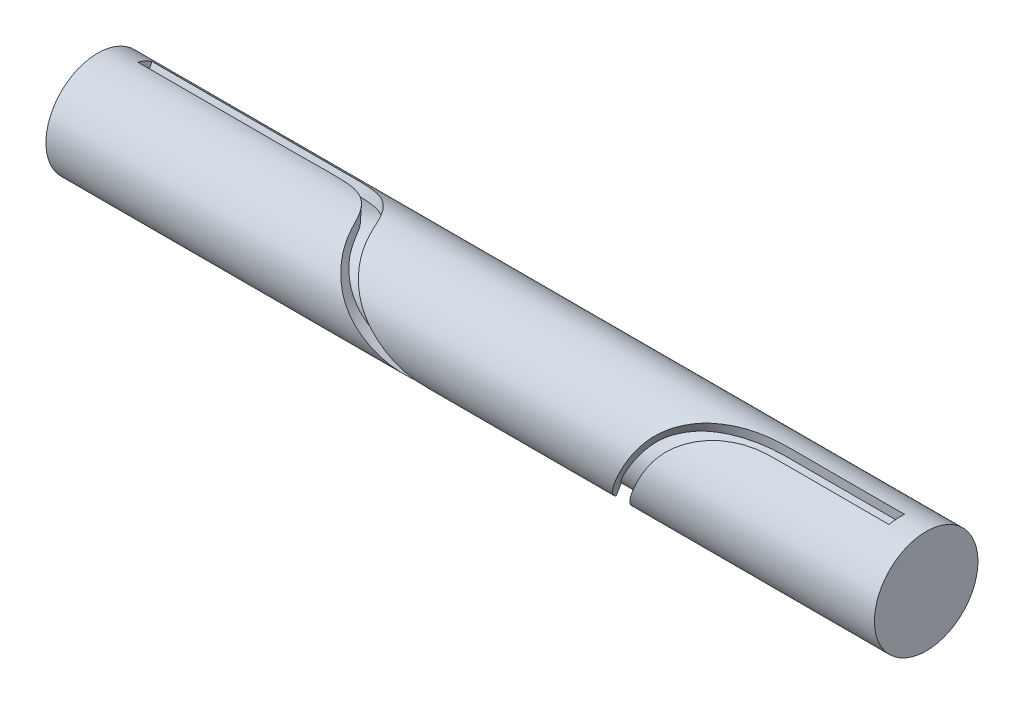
ISO-10303-21;
HEADER;
FILE_DESCRIPTION(('STEP AP214'),'2;1');
FILE_NAME('part.step','',(''),(''),'','','');
FILE_SCHEMA(('AUTOMOTIVE_DESIGN { 1 0 10303 214 1 1 1 1 }'));
ENDSEC;
DATA;
#1=APPLICATION_CONTEXT('core data for automotive mechanical design processes');
#2=APPLICATION_PROTOCOL_DEFINITION('international standard','automotive_design',2000,#1);
#3=PRODUCT_CONTEXT('',#1,'mechanical');
#4=PRODUCT('Part','Part','',(#3));
#5=PRODUCT_RELATED_PRODUCT_CATEGORY('part','',(#4));
#6=PRODUCT_DEFINITION_FORMATION('','',#4);
#7=PRODUCT_DEFINITION_CONTEXT('part definition',#1,'design');
#8=PRODUCT_DEFINITION('design','',#6,#7);
#9=PRODUCT_DEFINITION_SHAPE('','',#8);
#10=(LENGTH_UNIT() NAMED_UNIT(*) SI_UNIT(.MILLI.,.METRE.));
#11=(NAMED_UNIT(*) PLANE_ANGLE_UNIT() SI_UNIT($,.RADIAN.));
#12=(NAMED_UNIT(*) SI_UNIT($,.STERADIAN.) SOLID_ANGLE_UNIT());
#13=UNCERTAINTY_MEASURE_WITH_UNIT(LENGTH_MEASURE(1.E-05),#10,'distance_accuracy_value','');
#14=(GEOMETRIC_REPRESENTATION_CONTEXT(3) GLOBAL_UNCERTAINTY_ASSIGNED_CONTEXT((#13)) GLOBAL_UNIT_ASSIGNED_CONTEXT((#10,
#11,#12)) REPRESENTATION_CONTEXT('',''));
#15=CARTESIAN_POINT('',(0.,0.,0.));
#16=DIRECTION('',(0.,0.,1.));
#17=DIRECTION('',(1.,0.,0.));
#18=AXIS2_PLACEMENT_3D('',#15,#16,#17);
#19=CARTESIAN_POINT('',(80.,0.,0.));
#20=DIRECTION('',(-1.,0.,0.));
#21=DIRECTION('',(0.,0.,1.));
#22=AXIS2_PLACEMENT_3D('',#19,#20,#21);
#23=CYLINDRICAL_SURFACE('',#22,10.);
#24=CARTESIAN_POINT('',(74.9999999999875,0.,0.));
#25=DIRECTION('',(-1.,1.00488162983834E-12,0.));
#26=DIRECTION('',(-1.00488162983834E-12,-1.,0.));
#27=AXIS2_PLACEMENT_3D('',#24,#25,#26);
#28=CIRCLE('',#27,10.);
#29=CARTESIAN_POINT('',(74.9999999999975,9.75598744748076,2.19561128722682));
#30=VERTEX_POINT('',#29);
#31=CARTESIAN_POINT('',(74.9999999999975,9.96819905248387,-0.796873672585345));
#32=VERTEX_POINT('',#31);
#33=EDGE_CURVE('E453',#30,#32,#28,.T.);
#34=ORIENTED_EDGE('',*,*,#33,.F.);
#35=CARTESIAN_POINT('',(74.9999999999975,9.75598744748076,2.19561128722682));
#36=CARTESIAN_POINT('',(74.5458611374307,9.75596581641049,2.19570740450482));
#37=CARTESIAN_POINT('',(74.0917222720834,9.75594409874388,2.19580389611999));
#38=CARTESIAN_POINT('',(73.1834491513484,9.75590819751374,2.19596339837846));
#39=CARTESIAN_POINT('',(72.7293148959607,9.75589401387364,2.19602640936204));
#40=CARTESIAN_POINT('',(71.8210486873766,9.75588088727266,2.19608472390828));
#41=CARTESIAN_POINT('',(71.3669167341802,9.75588194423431,2.19608002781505));
#42=CARTESIAN_POINT('',(70.460839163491,9.75590586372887,2.19597376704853));
#43=CARTESIAN_POINT('',(70.0088935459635,9.75592862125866,2.19587266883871));
#44=CARTESIAN_POINT('',(69.1050001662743,9.75600645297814,2.19552684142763));
#45=CARTESIAN_POINT('',(68.6530524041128,9.75606152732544,2.1952821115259));
#46=CARTESIAN_POINT('',(67.749152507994,9.75617295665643,2.1947868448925));
#47=CARTESIAN_POINT('',(67.2972003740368,9.75622931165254,2.19453630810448));
#48=CARTESIAN_POINT('',(66.2069404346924,9.75631972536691,2.19413434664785));
#49=CARTESIAN_POINT('',(65.5686325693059,9.75633500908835,2.19406638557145));
#50=CARTESIAN_POINT('',(64.611174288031,9.75622695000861,2.19454681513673));
#51=CARTESIAN_POINT('',(64.2920237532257,9.756169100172,2.19480401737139));
#52=CARTESIAN_POINT('',(63.653723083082,9.75599007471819,2.19559964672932));
#53=CARTESIAN_POINT('',(63.3345729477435,9.75586889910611,2.19613807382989));
#54=CARTESIAN_POINT('',(62.6962864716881,9.75559484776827,2.19735512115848));
#55=CARTESIAN_POINT('',(62.3771501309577,9.75544197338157,2.1980337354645));
#56=CARTESIAN_POINT('',(61.738877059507,9.75515953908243,2.19928688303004));
#57=CARTESIAN_POINT('',(61.4197403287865,9.75502997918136,2.19986141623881));
#58=CARTESIAN_POINT('',(60.7795346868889,9.75484243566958,2.20069290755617));
#59=CARTESIAN_POINT('',(60.4584657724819,9.75478489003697,2.20094792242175));
#60=CARTESIAN_POINT('',(59.8163283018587,9.75479477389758,2.20090411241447));
#61=CARTESIAN_POINT('',(59.4952597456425,9.75486220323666,2.20060528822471));
#62=CARTESIAN_POINT('',(58.8531106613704,9.75516479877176,2.19926361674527));
#63=CARTESIAN_POINT('',(58.5320301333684,9.75539997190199,2.19822073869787));
#64=CARTESIAN_POINT('',(57.8898740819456,9.75610276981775,2.19509927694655));
#65=CARTESIAN_POINT('',(57.5687985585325,9.75657039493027,2.19302069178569));
#66=CARTESIAN_POINT('',(56.9265979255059,9.75759529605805,2.18845592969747));
#67=CARTESIAN_POINT('',(56.6054728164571,9.75815258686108,2.18596968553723));
#68=CARTESIAN_POINT('',(55.9632198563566,9.75917035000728,2.1814214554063));
#69=CARTESIAN_POINT('',(55.642092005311,9.75963082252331,2.17935946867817));
#70=CARTESIAN_POINT('',(54.966880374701,9.76031268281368,2.17630416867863));
#71=CARTESIAN_POINT('',(54.6127957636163,9.7605046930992,2.17544220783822));
#72=CARTESIAN_POINT('',(54.0816810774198,9.76034596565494,2.17615405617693));
#73=CARTESIAN_POINT('',(53.9046498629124,9.76021860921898,2.17672542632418));
#74=CARTESIAN_POINT('',(53.550592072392,9.75977814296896,2.17869955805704));
#75=CARTESIAN_POINT('',(53.3735654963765,9.75946503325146,2.18010231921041));
#76=CARTESIAN_POINT('',(53.019533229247,9.75860888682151,2.18393141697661));
#77=CARTESIAN_POINT('',(52.8425275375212,9.75806586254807,2.18635769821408));
#78=CARTESIAN_POINT('',(52.488535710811,9.75671322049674,2.19238611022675));
#79=CARTESIAN_POINT('',(52.3115495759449,9.7559036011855,2.19598824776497));
#80=CARTESIAN_POINT('',(51.9575802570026,9.75391444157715,2.20480712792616));
#81=CARTESIAN_POINT('',(51.7805970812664,9.75273482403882,2.21002420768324));
#82=CARTESIAN_POINT('',(51.4267226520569,9.74979066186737,2.22297699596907));
#83=CARTESIAN_POINT('',(51.249831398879,9.74802611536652,2.23071271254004));
#84=CARTESIAN_POINT('',(50.8977730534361,9.74371341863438,2.24947589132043));
#85=CARTESIAN_POINT('',(50.7226043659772,9.741172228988,2.26047408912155));
#86=CARTESIAN_POINT('',(50.3725933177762,9.73506625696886,2.28662767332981));
#87=CARTESIAN_POINT('',(50.1977509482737,9.73150150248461,2.30178294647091));
#88=CARTESIAN_POINT('',(49.8487009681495,9.72309134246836,2.33705497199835));
#89=CARTESIAN_POINT('',(49.6744930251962,9.71824675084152,2.35716857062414));
#90=CARTESIAN_POINT('',(49.3268644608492,9.70701354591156,2.40300604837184));
#91=CARTESIAN_POINT('',(49.1534438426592,9.70062492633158,2.428729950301));
#92=CARTESIAN_POINT('',(48.8076420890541,9.68625380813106,2.48542643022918));
#93=CARTESIAN_POINT('',(48.6352603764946,9.678272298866,2.51639574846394));
#94=CARTESIAN_POINT('',(48.2915608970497,9.6606192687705,2.58333688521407));
#95=CARTESIAN_POINT('',(48.1202431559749,9.65094770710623,2.61930882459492));
#96=CARTESIAN_POINT('',(47.6081797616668,9.61924676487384,2.73430747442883));
#97=CARTESIAN_POINT('',(47.2691678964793,9.5945248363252,2.82044303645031));
#98=CARTESIAN_POINT('',(46.6281972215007,9.53949364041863,3.00101922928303));
#99=CARTESIAN_POINT('',(46.3257390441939,9.5099234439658,3.093929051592));
#100=CARTESIAN_POINT('',(45.7259685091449,9.44280091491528,3.29310777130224));
#101=CARTESIAN_POINT('',(45.4286588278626,9.40524455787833,3.39938339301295));
#102=CARTESIAN_POINT('',(44.8400378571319,9.3208568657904,3.62437097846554));
#103=CARTESIAN_POINT('',(44.5487279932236,9.27402335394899,3.74308585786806));
#104=CARTESIAN_POINT('',(43.9713372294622,9.16937675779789,3.99261016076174));
#105=CARTESIAN_POINT('',(43.6852951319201,9.11150318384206,4.12348407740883));
#106=CARTESIAN_POINT('',(43.1211030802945,8.98340407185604,4.39557287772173));
#107=CARTESIAN_POINT('',(42.8429500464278,8.91318343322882,4.53678364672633));
#108=CARTESIAN_POINT('',(42.4324215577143,8.79730757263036,4.75543573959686));
#109=CARTESIAN_POINT('',(42.2967073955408,8.75692887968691,4.82945217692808));
#110=CARTESIAN_POINT('',(42.0275960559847,8.67245672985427,4.9795496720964));
#111=CARTESIAN_POINT('',(41.8941989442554,8.62836316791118,5.05563078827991));
#112=CARTESIAN_POINT('',(41.4330439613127,8.46783828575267,5.32404436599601));
#113=CARTESIAN_POINT('',(41.1113405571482,8.34136964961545,5.52095709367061));
#114=CARTESIAN_POINT('',(40.4833949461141,8.06239463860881,5.92091850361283));
#115=CARTESIAN_POINT('',(40.1771545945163,7.90988514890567,6.12396791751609));
#116=CARTESIAN_POINT('',(39.5821476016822,7.5774770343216,6.53073925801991));
#117=CARTESIAN_POINT('',(39.2933227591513,7.39767761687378,6.73445623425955));
#118=CARTESIAN_POINT('',(38.8735159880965,7.10602513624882,7.03733411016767));
#119=CARTESIAN_POINT('',(38.7358071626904,7.00513880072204,7.13785262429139));
#120=CARTESIAN_POINT('',(38.4650759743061,6.79587061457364,7.3373723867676));
#121=CARTESIAN_POINT('',(38.3320530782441,6.68748962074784,7.43637380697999));
#122=CARTESIAN_POINT('',(38.0557842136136,6.45014903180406,7.6435050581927));
#123=CARTESIAN_POINT('',(37.9131346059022,6.32025899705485,7.75136679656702));
#124=CARTESIAN_POINT('',(37.6341951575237,6.05098923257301,7.9633466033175));
#125=CARTESIAN_POINT('',(37.4979044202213,5.91161084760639,8.06746519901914));
#126=CARTESIAN_POINT('',(37.2320408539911,5.62336989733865,8.27096248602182));
#127=CARTESIAN_POINT('',(37.1024660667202,5.47451012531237,8.37034255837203));
#128=CARTESIAN_POINT('',(36.9134670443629,5.24412274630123,8.51512825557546));
#129=CARTESIAN_POINT('',(36.8513512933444,5.16613036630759,8.56268367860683));
#130=CARTESIAN_POINT('',(36.728966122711,5.00779748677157,8.65623591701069));
#131=CARTESIAN_POINT('',(36.6686967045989,4.92745698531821,8.70223273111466));
#132=CARTESIAN_POINT('',(36.4904760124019,4.68306173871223,8.83762405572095));
#133=CARTESIAN_POINT('',(36.3751217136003,4.51564477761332,8.92441217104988));
#134=CARTESIAN_POINT('',(36.1503574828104,4.17292629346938,9.0897137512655));
#135=CARTESIAN_POINT('',(36.0409480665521,3.99762408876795,9.1682264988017));
#136=CARTESIAN_POINT('',(35.8271332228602,3.64068064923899,9.31572061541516));
#137=CARTESIAN_POINT('',(35.7227174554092,3.45905399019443,9.38472229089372));
#138=CARTESIAN_POINT('',(35.5174108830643,3.09031838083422,9.51251881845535));
#139=CARTESIAN_POINT('',(35.4165199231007,2.90320967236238,9.57131412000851));
#140=CARTESIAN_POINT('',(35.2172794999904,2.52460614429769,9.67807068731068));
#141=CARTESIAN_POINT('',(35.1189299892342,2.33311140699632,9.72603215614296));
#142=CARTESIAN_POINT('',(34.9239707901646,1.94664174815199,9.81069512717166));
#143=CARTESIAN_POINT('',(34.827362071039,1.75166500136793,9.84739052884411));
#144=CARTESIAN_POINT('',(34.6352537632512,1.35933952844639,9.90916916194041));
#145=CARTESIAN_POINT('',(34.5397541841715,1.16199078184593,9.93425229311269));
#146=CARTESIAN_POINT('',(34.3492447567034,0.765901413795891,9.97261164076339));
#147=CARTESIAN_POINT('',(34.2542349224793,0.567160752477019,9.98588751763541));
#148=CARTESIAN_POINT('',(34.0847143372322,0.21230769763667,9.99896370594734));
#149=CARTESIAN_POINT('',(34.0102136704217,0.0562707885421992,10.0010572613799));
#150=CARTESIAN_POINT('',(33.8608954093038,-0.255594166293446,9.99794946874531));
#151=CARTESIAN_POINT('',(33.786077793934,-0.411422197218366,9.99274762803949));
#152=CARTESIAN_POINT('',(33.6361020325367,-0.722506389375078,9.97508164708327));
#153=CARTESIAN_POINT('',(33.5609438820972,-0.877762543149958,9.96261741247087));
#154=CARTESIAN_POINT('',(33.4103212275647,-1.18736107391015,9.9304784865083));
#155=CARTESIAN_POINT('',(33.3348567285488,-1.34170346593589,9.9108039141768));
#156=CARTESIAN_POINT('',(33.1079204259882,-1.80307596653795,9.84101968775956));
#157=CARTESIAN_POINT('',(32.9559699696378,-2.10831782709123,9.78015716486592));
#158=CARTESIAN_POINT('',(32.651075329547,-2.71128870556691,9.63044284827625));
#159=CARTESIAN_POINT('',(32.49813115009,-3.00901775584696,9.5415911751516));
#160=CARTESIAN_POINT('',(32.1906349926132,-3.59579303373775,9.33634506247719));
#161=CARTESIAN_POINT('',(32.0360789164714,-3.88479592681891,9.21983265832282));
#162=CARTESIAN_POINT('',(31.7274539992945,-4.45089796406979,8.96027205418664));
#163=CARTESIAN_POINT('',(31.5733851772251,-4.72799665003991,8.8172228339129));
#164=CARTESIAN_POINT('',(31.2671286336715,-5.26833131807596,8.50540477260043));
#165=CARTESIAN_POINT('',(31.1149402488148,-5.53157230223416,8.33664529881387));
#166=CARTESIAN_POINT('',(30.8890544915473,-5.91452500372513,8.06491887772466));
#167=CARTESIAN_POINT('',(30.8141515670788,-6.04020270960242,7.9712355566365));
#168=CARTESIAN_POINT('',(30.6653545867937,-6.28738344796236,7.77775233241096));
#169=CARTESIAN_POINT('',(30.591460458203,-6.40888678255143,7.67795287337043));
#170=CARTESIAN_POINT('',(30.4692238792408,-6.60757917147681,7.50672299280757));
#171=CARTESIAN_POINT('',(30.4205875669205,-6.6860193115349,7.43694582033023));
#172=CARTESIAN_POINT('',(30.323443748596,-6.84070106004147,7.29491882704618));
#173=CARTESIAN_POINT('',(30.2749362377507,-6.91694275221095,7.22266910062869));
#174=CARTESIAN_POINT('',(30.1291833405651,-7.14211584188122,7.00244414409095));
#175=CARTESIAN_POINT('',(30.0316980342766,-7.2875110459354,6.85097952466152));
#176=CARTESIAN_POINT('',(29.8339398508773,-7.56763829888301,6.54023169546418));
#177=CARTESIAN_POINT('',(29.7336670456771,-7.70237062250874,6.38094868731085));
#178=CARTESIAN_POINT('',(29.5287770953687,-7.96015020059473,6.05631152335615));
#179=CARTESIAN_POINT('',(29.4241664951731,-8.08321419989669,5.89096655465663));
#180=CARTESIAN_POINT('',(29.2094667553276,-8.31740402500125,5.55541810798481));
#181=CARTESIAN_POINT('',(29.0993770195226,-8.42852854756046,5.38521410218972));
#182=CARTESIAN_POINT('',(28.8731053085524,-8.63859099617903,5.0413591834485));
#183=CARTESIAN_POINT('',(28.7569234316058,-8.73752911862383,4.86770832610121));
#184=CARTESIAN_POINT('',(28.5418512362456,-8.9039309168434,4.55463327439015));
#185=CARTESIAN_POINT('',(28.4443062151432,-8.97368672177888,4.41549945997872));
#186=CARTESIAN_POINT('',(28.2439759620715,-9.10528512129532,4.13732329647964));
#187=CARTESIAN_POINT('',(28.1411922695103,-9.16713002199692,3.9982809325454));
#188=CARTESIAN_POINT('',(27.929646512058,-9.28294124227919,3.72149045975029));
#189=CARTESIAN_POINT('',(27.8208857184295,-9.33690922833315,3.58374208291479));
#190=CARTESIAN_POINT('',(27.6526461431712,-9.41204459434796,3.37915806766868));
#191=CARTESIAN_POINT('',(27.5957041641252,-9.4361246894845,3.31128923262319));
#192=CARTESIAN_POINT('',(27.4800188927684,-9.48236913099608,3.17643699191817));
#193=CARTESIAN_POINT('',(27.421275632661,-9.50453351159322,3.10945357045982));
#194=CARTESIAN_POINT('',(27.3018544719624,-9.54697127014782,2.97660965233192));
#195=CARTESIAN_POINT('',(27.2411764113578,-9.56724449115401,2.91074924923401));
#196=CARTESIAN_POINT('',(27.1179078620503,-9.60596573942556,2.78029717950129));
#197=CARTESIAN_POINT('',(27.055317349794,-9.62441374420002,2.71570552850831));
#198=CARTESIAN_POINT('',(26.8648344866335,-9.67715232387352,2.52394511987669));
#199=CARTESIAN_POINT('',(26.7342035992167,-9.70884703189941,2.3987606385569));
#200=CARTESIAN_POINT('',(26.4666310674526,-9.76596102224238,2.15446363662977));
#201=CARTESIAN_POINT('',(26.3297034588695,-9.79139352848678,2.03533874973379));
#202=CARTESIAN_POINT('',(26.0498954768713,-9.83680166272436,1.80314448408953));
#203=CARTESIAN_POINT('',(25.9070138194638,-9.85677610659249,1.69007642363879));
#204=CARTESIAN_POINT('',(25.6159161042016,-9.89196076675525,1.47020709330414));
#205=CARTESIAN_POINT('',(25.4676991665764,-9.90717019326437,1.36340686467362));
#206=CARTESIAN_POINT('',(25.1665614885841,-9.9334775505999,1.15625523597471));
#207=CARTESIAN_POINT('',(25.0136424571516,-9.94457695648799,1.05590153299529));
#208=CARTESIAN_POINT('',(24.7035668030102,-9.96328301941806,0.861677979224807));
#209=CARTESIAN_POINT('',(24.5464108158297,-9.97089019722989,0.76780716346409));
#210=CARTESIAN_POINT('',(24.2278428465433,-9.98315139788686,0.587266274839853));
#211=CARTESIAN_POINT('',(24.0664299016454,-9.98780474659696,0.500597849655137));
#212=CARTESIAN_POINT('',(23.7668248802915,-9.99414172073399,0.349111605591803));
#213=CARTESIAN_POINT('',(23.629262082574,-9.99619176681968,0.283063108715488));
#214=CARTESIAN_POINT('',(23.3513746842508,-9.99896634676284,0.156995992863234));
#215=CARTESIAN_POINT('',(23.2110499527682,-9.9996908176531,0.0969776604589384));
#216=CARTESIAN_POINT('',(22.9278389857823,-10.0001474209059,-0.0165386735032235));
#217=CARTESIAN_POINT('',(22.7849537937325,-9.99987994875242,-0.0700392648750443));
#218=CARTESIAN_POINT('',(22.5688712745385,-9.99897894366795,-0.145067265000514));
#219=CARTESIAN_POINT('',(22.4965696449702,-9.99859546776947,-0.169200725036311));
#220=CARTESIAN_POINT('',(22.3513932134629,-9.99770095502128,-0.215675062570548));
#221=CARTESIAN_POINT('',(22.2785184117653,-9.99718991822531,-0.238015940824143));
#222=CARTESIAN_POINT('',(22.0590607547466,-9.99551678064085,-0.302492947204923));
#223=CARTESIAN_POINT('',(21.9117184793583,-9.99421503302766,-0.342057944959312));
#224=CARTESIAN_POINT('',(21.6154787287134,-9.9914492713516,-0.415056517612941));
#225=CARTESIAN_POINT('',(21.4665806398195,-9.98998519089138,-0.448487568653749));
#226=CARTESIAN_POINT('',(21.1675770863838,-9.9870381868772,-0.50991577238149));
#227=CARTESIAN_POINT('',(21.0174709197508,-9.98555525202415,-0.537909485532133));
#228=CARTESIAN_POINT('',(20.7164040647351,-9.98266476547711,-0.589117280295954));
#229=CARTESIAN_POINT('',(20.5654431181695,-9.98125723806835,-0.612329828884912));
#230=CARTESIAN_POINT('',(20.2118744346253,-9.97812095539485,-0.661748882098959));
#231=CARTESIAN_POINT('',(20.0090388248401,-9.97644420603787,-0.686319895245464));
#232=CARTESIAN_POINT('',(19.6027212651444,-9.97337663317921,-0.729536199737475));
#233=CARTESIAN_POINT('',(19.3992392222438,-9.97198585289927,-0.748180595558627));
#234=CARTESIAN_POINT('',(19.093742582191,-9.97009877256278,-0.772784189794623));
#235=CARTESIAN_POINT('',(18.9918587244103,-9.96950289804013,-0.780425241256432));
#236=CARTESIAN_POINT('',(18.788025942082,-9.96836787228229,-0.794791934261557));
#237=CARTESIAN_POINT('',(18.6860770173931,-9.96782872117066,-0.801517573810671));
#238=CARTESIAN_POINT('',(18.3801655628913,-9.96629461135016,-0.820446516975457));
#239=CARTESIAN_POINT('',(18.176124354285,-9.96538291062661,-0.83140294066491));
#240=CARTESIAN_POINT('',(17.7678992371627,-9.96380700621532,-0.850081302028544));
#241=CARTESIAN_POINT('',(17.5637153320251,-9.96314279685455,-0.857803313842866));
#242=CARTESIAN_POINT('',(17.1552557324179,-9.96206467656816,-0.87023231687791));
#243=CARTESIAN_POINT('',(16.9509800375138,-9.96165076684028,-0.874939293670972));
#244=CARTESIAN_POINT('',(16.3367691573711,-9.96077020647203,-0.884937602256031));
#245=CARTESIAN_POINT('',(15.926763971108,-9.96066972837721,-0.88604931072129));
#246=CARTESIAN_POINT('',(15.1069801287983,-9.96119029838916,-0.880159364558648));
#247=CARTESIAN_POINT('',(14.6972014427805,-9.96181110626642,-0.873160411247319));
#248=CARTESIAN_POINT('',(13.8777090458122,-9.96337351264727,-0.855138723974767));
#249=CARTESIAN_POINT('',(13.4679953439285,-9.9643151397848,-0.844115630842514));
#250=CARTESIAN_POINT('',(12.7538763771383,-9.96586524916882,-0.825589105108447));
#251=CARTESIAN_POINT('',(12.4494756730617,-9.96649714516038,-0.817909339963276));
#252=CARTESIAN_POINT('',(11.8406252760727,-9.96754390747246,-0.805053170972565));
#253=CARTESIAN_POINT('',(11.536175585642,-9.96795878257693,-0.799876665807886));
#254=CARTESIAN_POINT('',(10.9272592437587,-9.96842719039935,-0.794022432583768));
#255=CARTESIAN_POINT('',(10.6227925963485,-9.96848075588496,-0.793344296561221));
#256=CARTESIAN_POINT('',(10.0139083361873,-9.96834837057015,-0.795002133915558));
#257=CARTESIAN_POINT('',(9.70949072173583,-9.96816244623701,-0.797337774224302));
#258=CARTESIAN_POINT('',(9.10002438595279,-9.9676602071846,-0.80359168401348));
#259=CARTESIAN_POINT('',(8.79497570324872,-9.96734361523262,-0.807513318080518));
#260=CARTESIAN_POINT('',(8.18486563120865,-9.96668772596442,-0.815568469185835));
#261=CARTESIAN_POINT('',(7.87980424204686,-9.96634842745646,-0.819701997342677));
#262=CARTESIAN_POINT('',(7.26957529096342,-9.96575441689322,-0.826893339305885));
#263=CARTESIAN_POINT('',(6.9644077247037,-9.96549973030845,-0.829950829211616));
#264=CARTESIAN_POINT('',(6.35387541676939,-9.96517900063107,-0.833793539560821));
#265=CARTESIAN_POINT('',(6.04851066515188,-9.96511306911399,-0.834577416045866));
#266=CARTESIAN_POINT('',(5.39662136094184,-9.96527510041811,-0.832644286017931));
#267=CARTESIAN_POINT('',(5.05009744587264,-9.96554387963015,-0.829441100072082));
#268=CARTESIAN_POINT('',(4.35708260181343,-9.96655136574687,-0.81724621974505));
#269=CARTESIAN_POINT('',(4.01059169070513,-9.96729015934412,-0.808253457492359));
#270=CARTESIAN_POINT('',(3.31798230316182,-9.96929094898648,-0.783203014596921));
#271=CARTESIAN_POINT('',(2.9718637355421,-9.97055274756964,-0.767148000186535));
#272=CARTESIAN_POINT('',(2.2804082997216,-9.97368894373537,-0.725240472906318));
#273=CARTESIAN_POINT('',(1.93507108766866,-9.97556297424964,-0.699393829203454));
#274=CARTESIAN_POINT('',(1.24557078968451,-9.97986177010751,-0.635156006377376));
#275=CARTESIAN_POINT('',(0.901407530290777,-9.98228645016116,-0.596766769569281));
#276=CARTESIAN_POINT('',(0.387707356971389,-9.9860909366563,-0.527726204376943));
#277=CARTESIAN_POINT('',(0.217381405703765,-9.98738307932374,-0.502890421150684));
#278=CARTESIAN_POINT('',(-0.122610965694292,-9.98994982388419,-0.449039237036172));
#279=CARTESIAN_POINT('',(-0.29227739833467,-9.99122442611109,-0.420023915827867));
#280=CARTESIAN_POINT('',(-0.630803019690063,-9.99366113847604,-0.357374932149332));
#281=CARTESIAN_POINT('',(-0.799661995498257,-9.99482322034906,-0.323740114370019));
#282=CARTESIAN_POINT('',(-1.13637386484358,-9.99689532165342,-0.251750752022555));
#283=CARTESIAN_POINT('',(-1.30422674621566,-9.99780533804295,-0.213396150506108));
#284=CARTESIAN_POINT('',(-1.63882873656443,-9.99920945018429,-0.132146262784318));
#285=CARTESIAN_POINT('',(-1.80557786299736,-9.99970355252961,-0.0892510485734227));
#286=CARTESIAN_POINT('',(-2.13787322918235,-10.0001015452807,0.000955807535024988));
#287=CARTESIAN_POINT('',(-2.30341946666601,-10.0000054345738,0.048267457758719));
#288=CARTESIAN_POINT('',(-2.79806395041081,-9.99855700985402,0.19659508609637));
#289=CARTESIAN_POINT('',(-3.12525895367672,-9.99604518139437,0.304025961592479));
#290=CARTESIAN_POINT('',(-3.77366855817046,-9.986358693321,0.534744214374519));
#291=CARTESIAN_POINT('',(-4.09488694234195,-9.97918709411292,0.658021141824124));
#292=CARTESIAN_POINT('',(-4.72790467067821,-9.95862412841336,0.917950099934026));
#293=CARTESIAN_POINT('',(-5.03976611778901,-9.94529574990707,1.05445586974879));
#294=CARTESIAN_POINT('',(-5.65683711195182,-9.91076216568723,1.34074016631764));
#295=CARTESIAN_POINT('',(-5.96204764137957,-9.88955813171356,1.49051671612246));
#296=CARTESIAN_POINT('',(-6.56537568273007,-9.83748540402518,1.80246875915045));
#297=CARTESIAN_POINT('',(-6.86349060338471,-9.80661323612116,1.96464869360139));
#298=CARTESIAN_POINT('',(-7.45178792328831,-9.73334705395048,2.30031928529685));
#299=CARTESIAN_POINT('',(-7.74197141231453,-9.69095463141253,2.47380837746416));
#300=CARTESIAN_POINT('',(-8.31357743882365,-9.59268767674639,2.83101389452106));
#301=CARTESIAN_POINT('',(-8.59500229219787,-9.53681674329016,3.01472757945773));
#302=CARTESIAN_POINT('',(-9.00980598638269,-9.44142220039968,3.29687549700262));
#303=CARTESIAN_POINT('',(-9.14680992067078,-9.40770501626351,3.39199026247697));
#304=CARTESIAN_POINT('',(-9.41835540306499,-9.33617465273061,3.58418167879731));
#305=CARTESIAN_POINT('',(-9.55289698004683,-9.29836152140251,3.6812583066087));
#306=CARTESIAN_POINT('',(-9.8201167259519,-9.21820143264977,3.87763689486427));
#307=CARTESIAN_POINT('',(-9.95278153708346,-9.17583188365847,3.97694781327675));
#308=CARTESIAN_POINT('',(-10.2154354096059,-9.08649080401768,4.1770432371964));
#309=CARTESIAN_POINT('',(-10.3454243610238,-9.03951908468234,4.27782780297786));
#310=CARTESIAN_POINT('',(-10.6026474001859,-8.94073909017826,4.48061475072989));
#311=CARTESIAN_POINT('',(-10.7298807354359,-8.8889295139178,4.58261745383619));
#312=CARTESIAN_POINT('',(-10.981426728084,-8.78026903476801,4.78751715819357));
#313=CARTESIAN_POINT('',(-11.1057396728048,-8.72341863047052,4.89041407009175));
#314=CARTESIAN_POINT('',(-11.2899778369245,-8.63419718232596,5.04521446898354));
#315=CARTESIAN_POINT('',(-11.3510376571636,-8.60378880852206,5.09690687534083));
#316=CARTESIAN_POINT('',(-11.4723633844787,-8.54162484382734,5.200412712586));
#317=CARTESIAN_POINT('',(-11.5326292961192,-8.50986926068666,5.25222614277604));
#318=CARTESIAN_POINT('',(-11.7124267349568,-8.41264233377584,5.40761873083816));
#319=CARTESIAN_POINT('',(-11.830950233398,-8.34521457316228,5.51114364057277));
#320=CARTESIAN_POINT('',(-12.0081094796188,-8.24086809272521,5.66497620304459));
#321=CARTESIAN_POINT('',(-12.067063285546,-8.20554860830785,5.71601559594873));
#322=CARTESIAN_POINT('',(-12.1848662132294,-8.13390722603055,5.81750871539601));
#323=CARTESIAN_POINT('',(-12.2437153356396,-8.09758533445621,5.86796244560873));
#324=CARTESIAN_POINT('',(-12.4200799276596,-7.98711864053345,6.01842341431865));
#325=CARTESIAN_POINT('',(-12.5374196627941,-7.91146866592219,6.11753655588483));
#326=CARTESIAN_POINT('',(-12.7716869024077,-7.7562780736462,6.31313969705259));
#327=CARTESIAN_POINT('',(-12.8886144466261,-7.67673784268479,6.40962995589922));
#328=CARTESIAN_POINT('',(-13.1221391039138,-7.51389090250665,6.59978195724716));
#329=CARTESIAN_POINT('',(-13.2387362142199,-7.43058416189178,6.69344367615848));
#330=CARTESIAN_POINT('',(-13.5881794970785,-7.17523099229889,6.96985858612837));
#331=CARTESIAN_POINT('',(-13.8207010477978,-6.9977360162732,7.14806120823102));
#332=CARTESIAN_POINT('',(-14.1676756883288,-6.72325971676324,7.40358789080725));
#333=CARTESIAN_POINT('',(-14.2821438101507,-6.63114729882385,7.48619886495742));
#334=CARTESIAN_POINT('',(-14.5112401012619,-6.44403492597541,7.64785577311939));
#335=CARTESIAN_POINT('',(-14.6258682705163,-6.34903497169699,7.72690170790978));
#336=CARTESIAN_POINT('',(-14.9699875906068,-6.05989346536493,7.95856102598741));
#337=CARTESIAN_POINT('',(-15.1997180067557,-5.86160673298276,8.1056992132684));
#338=CARTESIAN_POINT('',(-15.6595074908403,-5.45501596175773,8.38472378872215));
#339=CARTESIAN_POINT('',(-15.8895665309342,-5.24671272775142,8.51661139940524));
#340=CARTESIAN_POINT('',(-16.3505476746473,-4.82031934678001,8.76502237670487));
#341=CARTESIAN_POINT('',(-16.5814701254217,-4.60219922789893,8.88149371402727));
#342=CARTESIAN_POINT('',(-17.0429874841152,-4.15765745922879,9.09807554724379));
#343=CARTESIAN_POINT('',(-17.2735823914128,-3.93123579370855,9.19818601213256));
#344=CARTESIAN_POINT('',(-17.7347298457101,-3.47142985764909,9.38138721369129));
#345=CARTESIAN_POINT('',(-17.9652823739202,-3.23804414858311,9.46447440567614));
#346=CARTESIAN_POINT('',(-18.2861619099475,-2.90961261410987,9.56783920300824));
#347=CARTESIAN_POINT('',(-18.3764407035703,-2.8168117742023,9.59556931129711));
#348=CARTESIAN_POINT('',(-18.5570419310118,-2.63048167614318,9.64831267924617));
#349=CARTESIAN_POINT('',(-18.6473643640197,-2.53695243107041,9.67332598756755));
#350=CARTESIAN_POINT('',(-18.8280703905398,-2.34925171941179,9.72061659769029));
#351=CARTESIAN_POINT('',(-18.9184539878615,-2.25508020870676,9.74289370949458));
#352=CARTESIAN_POINT('',(-19.0993055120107,-2.06620419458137,9.7846893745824));
#353=CARTESIAN_POINT('',(-19.1897734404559,-1.97149968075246,9.80420787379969));
#354=CARTESIAN_POINT('',(-19.3707587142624,-1.78161626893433,9.84048913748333));
#355=CARTESIAN_POINT('',(-19.461276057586,-1.68643738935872,9.85725200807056));
#356=CARTESIAN_POINT('',(-19.6411084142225,-1.49453349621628,9.88816326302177));
#357=CARTESIAN_POINT('',(-19.7304234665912,-1.39780853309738,9.9023117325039));
#358=CARTESIAN_POINT('',(-19.9078971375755,-1.20291063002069,9.9278738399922));
#359=CARTESIAN_POINT('',(-19.996055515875,-1.10473739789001,9.939286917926));
#360=CARTESIAN_POINT('',(-20.17122456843,-0.907081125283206,9.95927047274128));
#361=CARTESIAN_POINT('',(-20.2582352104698,-0.807598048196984,9.96784086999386));
#362=CARTESIAN_POINT('',(-20.4306947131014,-0.607919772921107,9.98200397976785));
#363=CARTESIAN_POINT('',(-20.5161491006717,-0.507730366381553,9.98761092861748));
#364=CARTESIAN_POINT('',(-20.685914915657,-0.306272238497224,9.99581719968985));
#365=CARTESIAN_POINT('',(-20.7702263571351,-0.20500353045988,9.99841655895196));
#366=CARTESIAN_POINT('',(-21.0214446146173,0.100302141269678,10.0015682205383));
#367=CARTESIAN_POINT('',(-21.186629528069,0.305831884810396,9.99747361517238));
#368=CARTESIAN_POINT('',(-21.5119502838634,0.720067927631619,9.97619729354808));
#369=CARTESIAN_POINT('',(-21.6720879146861,0.928773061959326,9.95902026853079));
#370=CARTESIAN_POINT('',(-21.986713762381,1.34869179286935,9.91088546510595));
#371=CARTESIAN_POINT('',(-22.1412044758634,1.55990422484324,9.87993385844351));
#372=CARTESIAN_POINT('',(-22.4927927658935,2.05110887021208,9.79149851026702));
#373=CARTESIAN_POINT('',(-22.6878376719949,2.33163921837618,9.72871009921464));
#374=CARTESIAN_POINT('',(-23.0680367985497,2.89226227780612,9.57701063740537));
#375=CARTESIAN_POINT('',(-23.2531930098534,3.17235506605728,9.48810486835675));
#376=CARTESIAN_POINT('',(-23.6138739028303,3.72946474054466,9.28327983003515));
#377=CARTESIAN_POINT('',(-23.7893852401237,4.00647696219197,9.16732424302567));
#378=CARTESIAN_POINT('',(-24.1305169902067,4.55380975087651,8.90811465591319));
#379=CARTESIAN_POINT('',(-24.2961365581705,4.82412974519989,8.76485832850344));
#380=CARTESIAN_POINT('',(-24.618290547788,5.35619895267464,8.45027776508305));
#381=CARTESIAN_POINT('',(-24.7747699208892,5.61789277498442,8.27880331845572));
#382=CARTESIAN_POINT('',(-25.0773639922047,6.12786839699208,7.90875655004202));
#383=CARTESIAN_POINT('',(-25.2234792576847,6.37615093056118,7.71018571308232));
#384=CARTESIAN_POINT('',(-25.4341597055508,6.73576393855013,7.39290303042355));
#385=CARTESIAN_POINT('',(-25.5029164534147,6.85340556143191,7.28400484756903));
#386=CARTESIAN_POINT('',(-25.6375425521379,7.08415920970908,7.05978433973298));
#387=CARTESIAN_POINT('',(-25.7034118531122,7.19727115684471,6.94446190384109));
#388=CARTESIAN_POINT('',(-25.8322857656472,7.41850517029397,6.70761055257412));
#389=CARTESIAN_POINT('',(-25.8952904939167,7.52662743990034,6.58608189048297));
#390=CARTESIAN_POINT('',(-26.0187224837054,7.73739490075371,6.33713837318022));
#391=CARTESIAN_POINT('',(-26.0791499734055,7.84004057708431,6.2097240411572));
#392=CARTESIAN_POINT('',(-26.2096282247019,8.0595520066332,5.9230433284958));
#393=CARTESIAN_POINT('',(-26.2791623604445,8.17511136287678,5.76253501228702));
#394=CARTESIAN_POINT('',(-26.3812479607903,8.34152891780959,5.51622354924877));
#395=CARTESIAN_POINT('',(-26.4149080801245,8.3958491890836,5.43319264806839));
#396=CARTESIAN_POINT('',(-26.4815328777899,8.50211540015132,5.26534896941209));
#397=CARTESIAN_POINT('',(-26.5144975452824,8.55406130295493,5.18053616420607));
#398=CARTESIAN_POINT('',(-26.6125433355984,8.70619669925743,4.92359053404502));
#399=CARTESIAN_POINT('',(-26.6767841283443,8.80269685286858,4.74893130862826));
#400=CARTESIAN_POINT('',(-26.8043779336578,8.98519287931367,4.3938789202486));
#401=CARTESIAN_POINT('',(-26.8677308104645,9.0711871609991,4.21348489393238));
#402=CARTESIAN_POINT('',(-26.995050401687,9.23213937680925,3.84804335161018));
#403=CARTESIAN_POINT('',(-27.0590170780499,9.30709799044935,3.66299612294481));
#404=CARTESIAN_POINT('',(-27.1569904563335,9.41092003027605,3.38297324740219));
#405=CARTESIAN_POINT('',(-27.1899857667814,9.44409164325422,3.28922280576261));
#406=CARTESIAN_POINT('',(-27.2402824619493,9.49166123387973,3.14814685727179));
#407=CARTESIAN_POINT('',(-27.2571818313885,9.50715300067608,3.10104690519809));
#408=CARTESIAN_POINT('',(-27.2913028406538,9.53740228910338,3.00672796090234));
#409=CARTESIAN_POINT('',(-27.3085244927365,9.55215978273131,2.95950896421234));
#410=CARTESIAN_POINT('',(-27.3721856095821,9.60463180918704,2.78713595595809));
#411=CARTESIAN_POINT('',(-27.4200064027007,9.64010214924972,2.66177960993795));
#412=CARTESIAN_POINT('',(-27.4960954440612,9.68922034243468,2.47450674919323));
#413=CARTESIAN_POINT('',(-27.5221752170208,9.70490724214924,2.41223032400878));
#414=CARTESIAN_POINT('',(-27.5760419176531,9.73492359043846,2.28808638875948));
#415=CARTESIAN_POINT('',(-27.6038288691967,9.74925302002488,2.22621888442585));
#416=CARTESIAN_POINT('',(-27.661040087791,9.77657845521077,2.10297332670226));
#417=CARTESIAN_POINT('',(-27.6904638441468,9.78957487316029,2.04159512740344));
#418=CARTESIAN_POINT('',(-27.7508990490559,9.81427182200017,1.91936368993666));
#419=CARTESIAN_POINT('',(-27.7819105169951,9.825972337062,1.85851045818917));
#420=CARTESIAN_POINT('',(-27.876989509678,9.85908768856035,1.6773251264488));
#421=CARTESIAN_POINT('',(-27.9433469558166,9.87863246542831,1.55783993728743));
#422=CARTESIAN_POINT('',(-28.0819385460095,9.91301572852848,1.32151099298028));
#423=CARTESIAN_POINT('',(-28.1541775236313,9.92785029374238,1.20466951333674));
#424=CARTESIAN_POINT('',(-28.3043021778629,9.9531131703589,0.974158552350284));
#425=CARTESIAN_POINT('',(-28.3821888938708,9.96354066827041,0.860489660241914));
#426=CARTESIAN_POINT('',(-28.5834361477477,9.98448716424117,0.58147377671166));
#427=CARTESIAN_POINT('',(-28.7102255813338,9.99249760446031,0.418391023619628));
#428=CARTESIAN_POINT('',(-28.9753617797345,10.0007352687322,0.101838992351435));
#429=CARTESIAN_POINT('',(-29.1137046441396,10.0009651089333,-0.0516334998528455));
#430=CARTESIAN_POINT('',(-29.4019161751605,9.99502547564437,-0.348817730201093));
#431=CARTESIAN_POINT('',(-29.551843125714,9.98882138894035,-0.492472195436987));
#432=CARTESIAN_POINT('',(-29.8616911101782,9.97140385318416,-0.768245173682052));
#433=CARTESIAN_POINT('',(-30.0216130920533,9.96018992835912,-0.900362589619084));
#434=CARTESIAN_POINT('',(-30.3604513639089,9.93340930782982,-1.15992094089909));
#435=CARTESIAN_POINT('',(-30.5399315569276,9.91762132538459,-1.2866023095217));
#436=CARTESIAN_POINT('',(-30.9081702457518,9.883692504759,-1.52550910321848));
#437=CARTESIAN_POINT('',(-31.0969318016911,9.86555088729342,-1.63772971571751));
#438=CARTESIAN_POINT('',(-31.3856529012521,9.83788992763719,-1.79407306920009));
#439=CARTESIAN_POINT('',(-31.4825065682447,9.82862499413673,-1.84404960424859));
#440=CARTESIAN_POINT('',(-31.6781790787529,9.81013193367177,-1.94002575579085));
#441=CARTESIAN_POINT('',(-31.7769979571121,9.80090380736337,-1.98602530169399));
#442=CARTESIAN_POINT('',(-31.9764093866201,9.78270029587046,-2.0738331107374));
#443=CARTESIAN_POINT('',(-32.0770004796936,9.77372471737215,-2.11564464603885));
#444=CARTESIAN_POINT('',(-32.2799266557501,9.75622874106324,-2.19491424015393));
#445=CARTESIAN_POINT('',(-32.3822617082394,9.74770833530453,-2.23237237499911));
#446=CARTESIAN_POINT('',(-32.5531361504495,9.73414376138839,-2.29063468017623));
#447=CARTESIAN_POINT('',(-32.6212184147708,9.72891027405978,-2.31274190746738));
#448=CARTESIAN_POINT('',(-32.758044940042,9.71879357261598,-2.35489294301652));
#449=CARTESIAN_POINT('',(-32.8267892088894,9.71391036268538,-2.37493672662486));
#450=CARTESIAN_POINT('',(-33.0339002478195,9.69982766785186,-2.43205519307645));
#451=CARTESIAN_POINT('',(-33.1731447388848,9.6911951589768,-2.46611681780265));
#452=CARTESIAN_POINT('',(-33.4534144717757,9.67546271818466,-2.52713489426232));
#453=CARTESIAN_POINT('',(-33.5944416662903,9.66836465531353,-2.55408268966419));
#454=CARTESIAN_POINT('',(-33.8775760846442,9.6556069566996,-2.6018964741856));
#455=CARTESIAN_POINT('',(-34.01968333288,9.64994735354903,-2.6227623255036));
#456=CARTESIAN_POINT('',(-34.3058671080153,9.63982304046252,-2.65973312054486));
#457=CARTESIAN_POINT('',(-34.4499497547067,9.63536974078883,-2.67579274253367));
#458=CARTESIAN_POINT('',(-34.7385105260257,9.62747604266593,-2.70405598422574));
#459=CARTESIAN_POINT('',(-34.8829886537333,9.62403565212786,-2.7162595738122));
#460=CARTESIAN_POINT('',(-35.1721006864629,9.61788885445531,-2.73794442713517));
#461=CARTESIAN_POINT('',(-35.3167345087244,9.61518216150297,-2.74742675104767));
#462=CARTESIAN_POINT('',(-35.606114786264,9.61027154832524,-2.76455380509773));
#463=CARTESIAN_POINT('',(-35.7508612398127,9.60806762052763,-2.77219856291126));
#464=CARTESIAN_POINT('',(-36.1160377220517,9.6030939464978,-2.7893917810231));
#465=CARTESIAN_POINT('',(-36.3365234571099,9.60062960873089,-2.7978500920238));
#466=CARTESIAN_POINT('',(-36.7775983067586,9.59659118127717,-2.81166984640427));
#467=CARTESIAN_POINT('',(-36.9981874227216,9.59501710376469,-2.81703124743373));
#468=CARTESIAN_POINT('',(-37.4394220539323,9.5926092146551,-2.82521974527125));
#469=CARTESIAN_POINT('',(-37.6600675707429,9.59177542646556,-2.82804676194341));
#470=CARTESIAN_POINT('',(-38.1013743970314,9.59071401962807,-2.83164392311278));
#471=CARTESIAN_POINT('',(-38.322035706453,9.59048639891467,-2.83241407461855));
#472=CARTESIAN_POINT('',(-38.9840506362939,9.59053104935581,-2.83226349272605));
#473=CARTESIAN_POINT('',(-39.425402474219,9.59153097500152,-2.8288812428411));
#474=CARTESIAN_POINT('',(-40.3057631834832,9.59464451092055,-2.81830126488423));
#475=CARTESIAN_POINT('',(-40.7447723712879,9.59675233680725,-2.81112335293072));
#476=CARTESIAN_POINT('',(-41.6227156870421,9.60140221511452,-2.79520002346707));
#477=CARTESIAN_POINT('',(-42.0616498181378,9.6039442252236,-2.78645475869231));
#478=CARTESIAN_POINT('',(-42.7200527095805,9.60761933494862,-2.77374686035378));
#479=CARTESIAN_POINT('',(-42.9395171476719,9.6088213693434,-2.76957929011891));
#480=CARTESIAN_POINT('',(-43.3784537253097,9.61110671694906,-2.76163796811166));
#481=CARTESIAN_POINT('',(-43.597925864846,9.61219003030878,-2.75786421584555));
#482=CARTESIAN_POINT('',(-44.0369193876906,9.61414955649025,-2.75102551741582));
#483=CARTESIAN_POINT('',(-44.2564407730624,9.61502573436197,-2.74796069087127));
#484=CARTESIAN_POINT('',(-44.6954939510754,9.61655141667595,-2.7426167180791));
#485=CARTESIAN_POINT('',(-44.9150257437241,9.61720092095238,-2.74033757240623));
#486=CARTESIAN_POINT('',(-45.573647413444,9.61885149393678,-2.73454073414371));
#487=CARTESIAN_POINT('',(-46.0127473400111,9.61955455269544,-2.7320638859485));
#488=CARTESIAN_POINT('',(-46.8909589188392,9.62033050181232,-2.72932999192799));
#489=CARTESIAN_POINT('',(-47.3300705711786,9.6204033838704,-2.72907297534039));
#490=CARTESIAN_POINT('',(-48.2092064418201,9.62010377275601,-2.73012883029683));
#491=CARTESIAN_POINT('',(-48.6492306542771,9.61973035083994,-2.73144497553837));
#492=CARTESIAN_POINT('',(-49.5292686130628,9.61873200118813,-2.73495844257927));
#493=CARTESIAN_POINT('',(-49.9692823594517,9.61810707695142,-2.73715575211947));
#494=CARTESIAN_POINT('',(-50.6293009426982,9.61713463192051,-2.74056983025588));
#495=CARTESIAN_POINT('',(-50.8493061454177,9.61680464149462,-2.74172753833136));
#496=CARTESIAN_POINT('',(-51.2893168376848,9.61615860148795,-2.74399255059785));
#497=CARTESIAN_POINT('',(-51.5093223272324,9.61584255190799,-2.74509985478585));
#498=CARTESIAN_POINT('',(-52.1180338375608,9.61502510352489,-2.74796211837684));
#499=CARTESIAN_POINT('',(-52.5067407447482,9.61456740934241,-2.7495626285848));
#500=CARTESIAN_POINT('',(-53.2841574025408,9.61390862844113,-2.75186530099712));
#501=CARTESIAN_POINT('',(-53.6728671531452,9.61370754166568,-2.75256746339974));
#502=CARTESIAN_POINT('',(-54.4502891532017,9.61348323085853,-2.75335071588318));
#503=CARTESIAN_POINT('',(-54.8390014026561,9.6134600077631,-2.75343180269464));
#504=CARTESIAN_POINT('',(-55.6164259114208,9.61352533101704,-2.75320372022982));
#505=CARTESIAN_POINT('',(-56.005138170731,9.61361387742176,-2.75289455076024));
#506=CARTESIAN_POINT('',(-56.7825653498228,9.61383669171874,-2.75211631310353));
#507=CARTESIAN_POINT('',(-57.1712802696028,9.6139709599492,-2.75164724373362));
#508=CARTESIAN_POINT('',(-57.9487102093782,9.61421324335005,-2.75080059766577));
#509=CARTESIAN_POINT('',(-58.3374252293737,9.61432125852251,-2.75042302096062));
#510=CARTESIAN_POINT('',(-59.1148569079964,9.61446887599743,-2.74990696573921));
#511=CARTESIAN_POINT('',(-59.5035735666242,9.61450847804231,-2.7497684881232));
#512=CARTESIAN_POINT('',(-60.2810069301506,9.61454621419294,-2.74963653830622));
#513=CARTESIAN_POINT('',(-60.6697236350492,9.61454434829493,-2.7496430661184));
#514=CARTESIAN_POINT('',(-61.8358753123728,9.61449787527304,-2.74980555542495));
#515=CARTESIAN_POINT('',(-62.6133102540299,9.61441239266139,-2.75010442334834));
#516=CARTESIAN_POINT('',(-64.1647031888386,9.61429543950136,-2.75051327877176));
#517=CARTESIAN_POINT('',(-64.938661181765,9.61426372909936,-2.75062410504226));
#518=CARTESIAN_POINT('',(-66.4865752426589,9.61424963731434,-2.75067335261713));
#519=CARTESIAN_POINT('',(-67.2605313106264,9.61426725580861,-2.75061177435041));
#520=CARTESIAN_POINT('',(-68.8084396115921,9.6143026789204,-2.75048795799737));
#521=CARTESIAN_POINT('',(-69.5823918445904,9.614320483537,-2.75042571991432));
#522=CARTESIAN_POINT('',(-71.1302905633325,9.61433813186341,-2.75036402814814));
#523=CARTESIAN_POINT('',(-71.9042370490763,9.61433797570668,-2.7503645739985));
#524=CARTESIAN_POINT('',(-73.4521223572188,9.61433022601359,-2.750391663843));
#525=CARTESIAN_POINT('',(-74.2260611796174,9.61432263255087,-2.75041820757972));
#526=CARTESIAN_POINT('',(-75.,9.61431658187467,-2.75043935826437));
#527=B_SPLINE_CURVE_WITH_KNOTS('',3,(#35,#36,#37,#38,#39,#40,#41,#42,#43,#44,#45,#46,#47,#48,
#49,#50,#51,#52,#53,#54,#55,#56,#57,#58,#59,#60,#61,#62,#63,#64,#65,#66,#67,#68,#69,#70,#71,#72,
#73,#74,#75,#76,#77,#78,#79,#80,#81,#82,#83,#84,#85,#86,#87,#88,#89,#90,#91,#92,#93,#94,#95,#96,
#97,#98,#99,#100,#101,#102,#103,#104,#105,#106,#107,#108,#109,#110,#111,#112,#113,#114,#115,
#116,#117,#118,#119,#120,#121,#122,#123,#124,#125,#126,#127,#128,#129,#130,#131,#132,#133,#134,
#135,#136,#137,#138,#139,#140,#141,#142,#143,#144,#145,#146,#147,#148,#149,#150,#151,#152,#153,
#154,#155,#156,#157,#158,#159,#160,#161,#162,#163,#164,#165,#166,#167,#168,#169,#170,#171,#172,
#173,#174,#175,#176,#177,#178,#179,#180,#181,#182,#183,#184,#185,#186,#187,#188,#189,#190,#191,
#192,#193,#194,#195,#196,#197,#198,#199,#200,#201,#202,#203,#204,#205,#206,#207,#208,#209,#210,
#211,#212,#213,#214,#215,#216,#217,#218,#219,#220,#221,#222,#223,#224,#225,#226,#227,#228,#229,
#230,#231,#232,#233,#234,#235,#236,#237,#238,#239,#240,#241,#242,#243,#244,#245,#246,#247,#248,
#249,#250,#251,#252,#253,#254,#255,#256,#257,#258,#259,#260,#261,#262,#263,#264,#265,#266,#267,
#268,#269,#270,#271,#272,#273,#274,#275,#276,#277,#278,#279,#280,#281,#282,#283,#284,#285,#286,
#287,#288,#289,#290,#291,#292,#293,#294,#295,#296,#297,#298,#299,#300,#301,#302,#303,#304,#305,
#306,#307,#308,#309,#310,#311,#312,#313,#314,#315,#316,#317,#318,#319,#320,#321,#322,#323,#324,
#325,#326,#327,#328,#329,#330,#331,#332,#333,#334,#335,#336,#337,#338,#339,#340,#341,#342,#343,
#344,#345,#346,#347,#348,#349,#350,#351,#352,#353,#354,#355,#356,#357,#358,#359,#360,#361,#362,
#363,#364,#365,#366,#367,#368,#369,#370,#371,#372,#373,#374,#375,#376,#377,#378,#379,#380,#381,
#382,#383,#384,#385,#386,#387,#388,#389,#390,#391,#392,#393,#394,#395,#396,#397,#398,#399,#400,
#401,#402,#403,#404,#405,#406,#407,#408,#409,#410,#411,#412,#413,#414,#415,#416,#417,#418,#419,
#420,#421,#422,#423,#424,#425,#426,#427,#428,#429,#430,#431,#432,#433,#434,#435,#436,#437,#438,
#439,#440,#441,#442,#443,#444,#445,#446,#447,#448,#449,#450,#451,#452,#453,#454,#455,#456,#457,
#458,#459,#460,#461,#462,#463,#464,#465,#466,#467,#468,#469,#470,#471,#472,#473,#474,#475,#476,
#477,#478,#479,#480,#481,#482,#483,#484,#485,#486,#487,#488,#489,#490,#491,#492,#493,#494,#495,
#496,#497,#498,#499,#500,#501,#502,#503,#504,#505,#506,#507,#508,#509,#510,#511,#512,#513,#514,
#515,#516,#517,#518,#519,#520,#521,#522,#523,#524,#525,#526),.UNSPECIFIED.,.F.,.F.,(4,2,2,2,2,2,
2,2,2,2,2,2,2,2,2,2,2,2,2,2,2,2,2,2,2,2,2,2,2,2,2,2,2,2,2,2,2,2,2,2,2,2,2,2,2,2,2,2,2,2,2,2,2,2,
2,2,2,2,2,2,2,2,2,2,2,2,2,2,2,2,2,2,2,2,2,2,2,2,2,2,2,2,2,2,2,2,2,2,2,2,2,2,2,2,2,2,2,2,2,2,2,2,
2,2,2,2,2,2,2,2,2,2,2,2,2,2,2,2,2,2,2,2,2,2,2,2,2,2,2,2,2,2,2,2,2,2,2,2,2,2,2,2,2,2,2,2,2,2,2,2,
2,2,2,2,2,2,2,2,2,2,2,2,2,2,2,2,2,2,2,2,2,2,2,2,2,2,2,2,2,2,2,2,2,2,2,2,2,2,2,2,2,2,2,2,2,2,2,2,
2,2,2,2,2,2,2,2,2,2,2,2,2,2,2,2,2,2,2,2,2,2,2,2,2,2,2,2,2,2,2,2,2,2,2,2,2,2,2,2,2,2,2,2,2,2,2,
4),(0.,1.36241662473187,2.72481940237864,4.08721525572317,5.44305212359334,6.79889560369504,
8.15475224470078,10.0696755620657,11.0271273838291,11.9845791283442,12.9419904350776,
13.8994022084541,14.8626089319,15.825814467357,16.7890598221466,17.7523065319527,
18.7157122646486,19.6791162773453,20.7413658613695,21.2724607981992,21.8035554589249,
22.3346213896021,22.8656903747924,23.3968703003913,23.9280519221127,24.4546059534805,
24.9811456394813,25.5073512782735,26.0335590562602,26.5594410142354,27.0853356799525,
28.1366508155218,29.0896134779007,30.0430575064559,30.9967255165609,31.9557771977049,
32.9144491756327,33.3936995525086,33.8729634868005,35.0651423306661,36.2574638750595,
37.4455504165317,38.0396993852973,38.6337805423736,39.2965523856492,39.959230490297,
40.6217142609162,40.9530669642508,41.2844199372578,41.9471754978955,42.6099884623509,
43.2713636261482,43.9327096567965,44.5940432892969,45.2557344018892,45.9174312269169,
46.579147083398,47.0977680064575,47.6164239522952,48.1350866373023,48.6537407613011,
49.6914927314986,50.7292402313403,51.771495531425,52.8137909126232,53.8557074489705,
54.3767667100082,54.8977881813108,55.2448527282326,55.5919040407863,56.2859379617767,
56.9799539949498,57.6729584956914,58.3660385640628,59.0591074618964,59.6099255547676,
60.160582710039,60.7111231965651,60.9865081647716,61.2618882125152,61.5372910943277,
61.8126973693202,62.363384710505,62.9128989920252,63.4625323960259,64.0122568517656,
64.5617838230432,65.1112288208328,65.6607991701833,66.1184925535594,66.5762076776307,
67.0337403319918,67.2623921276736,67.4910438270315,67.9485813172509,68.4063066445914,
68.864320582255,69.3224811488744,69.9353394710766,70.5482903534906,70.8548021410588,
71.1613145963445,71.7742973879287,72.387266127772,73.0002378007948,74.2301248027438,
75.4596022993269,76.6891895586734,77.602683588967,78.5161406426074,79.4295148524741,
80.3427881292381,81.2580091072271,82.1732781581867,83.0888224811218,84.0049078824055,
85.044485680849,86.084255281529,87.1236326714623,88.162388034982,89.2009826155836,
89.7173359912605,90.2336795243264,90.7501524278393,91.2666315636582,91.7831025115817,
92.2995744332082,93.3322376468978,94.3642233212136,95.3858772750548,96.4073792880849,
97.4292487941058,98.4509771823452,99.472433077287,99.9828418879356,100.49324470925,
101.006306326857,101.51938898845,102.032610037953,102.545780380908,102.802528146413,
103.059274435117,103.572799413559,103.829606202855,104.086411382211,104.599991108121,
105.113519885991,105.6270529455,106.654016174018,107.159644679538,107.665273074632,
108.676510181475,109.687666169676,110.702152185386,111.716640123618,112.731339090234,
113.128534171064,113.525722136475,113.922937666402,114.320160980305,114.71736899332,
115.114564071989,115.511840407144,115.909127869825,116.304489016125,116.69984529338,
117.490584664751,118.281040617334,119.071142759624,120.112197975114,121.153042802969,
122.195293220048,123.237632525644,124.28571141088,125.333732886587,125.856858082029,
126.379992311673,126.903105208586,127.426171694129,128.054714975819,128.369003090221,
128.683296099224,129.311808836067,129.940416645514,130.568985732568,130.883275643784,
131.040417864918,131.197566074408,131.613678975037,131.821594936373,132.029513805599,
132.237368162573,132.445225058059,132.859162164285,133.273442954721,133.687800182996,
134.307217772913,134.926427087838,135.54898499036,136.171602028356,136.831677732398,
137.491972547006,137.820041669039,138.148116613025,138.475933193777,138.803744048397,
139.019031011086,139.234320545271,139.664901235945,140.096003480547,140.52711549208,
140.962173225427,141.397234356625,141.832125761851,142.267010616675,142.928963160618,
143.590924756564,144.252907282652,144.914887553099,146.238946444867,147.556160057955,
148.873245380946,149.531767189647,150.190288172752,150.84892018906,151.507552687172,
152.824866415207,154.142197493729,155.462274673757,156.782333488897,157.442358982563,
158.102384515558,159.268515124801,160.434645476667,161.600781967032,162.766919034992,
163.933064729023,165.099210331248,166.265360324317,167.431510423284,169.763815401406,
172.085689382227,174.407557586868,176.729414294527,179.051253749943,181.373070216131),.UNSPECIFIED.);
#528=CARTESIAN_POINT('',(-75.,9.61431658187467,-2.75043935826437));
#529=VERTEX_POINT('',#528);
#530=EDGE_CURVE('E14',#30,#529,#527,.T.);
#531=ORIENTED_EDGE('',*,*,#530,.T.);
#532=CARTESIAN_POINT('',(-75.,0.,0.));
#533=DIRECTION('',(-1.,0.,0.));
#534=DIRECTION('',(0.,0.,1.));
#535=AXIS2_PLACEMENT_3D('',#532,#533,#534);
#536=CIRCLE('',#535,10.);
#537=CARTESIAN_POINT('',(-75.,8.36587607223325,-5.47833163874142));
#538=VERTEX_POINT('',#537);
#539=EDGE_CURVE('E681',#529,#538,#536,.T.);
#540=ORIENTED_EDGE('',*,*,#539,.T.);
#541=CARTESIAN_POINT('',(-75.,8.36587607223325,-5.47833163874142));
#542=CARTESIAN_POINT('',(-74.3203380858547,8.36589148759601,-5.4783080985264));
#543=CARTESIAN_POINT('',(-73.6406761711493,8.36590886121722,-5.47828156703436));
#544=CARTESIAN_POINT('',(-72.2813528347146,8.36593006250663,-5.47824919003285));
#545=CARTESIAN_POINT('',(-71.6016914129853,8.36593389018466,-5.47824334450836));
#546=CARTESIAN_POINT('',(-70.2425666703,8.36591054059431,-5.47827900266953));
#547=CARTESIAN_POINT('',(-69.563103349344,8.36588337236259,-5.47832049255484));
#548=CARTESIAN_POINT('',(-68.2041762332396,8.36580579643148,-5.47843895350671));
#549=CARTESIAN_POINT('',(-67.5247124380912,8.36575538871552,-5.47851592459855));
#550=CARTESIAN_POINT('',(-65.9393735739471,8.36569194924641,-5.47861280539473));
#551=CARTESIAN_POINT('',(-65.0334984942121,8.36569696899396,-5.47860515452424));
#552=CARTESIAN_POINT('',(-63.2217490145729,8.36598294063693,-5.4781684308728));
#553=CARTESIAN_POINT('',(-62.3158746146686,8.36626389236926,-5.47773935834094));
#554=CARTESIAN_POINT('',(-60.9570642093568,8.36646884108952,-5.47742632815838));
#555=CARTESIAN_POINT('',(-60.5041282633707,8.36650107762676,-5.47737708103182));
#556=CARTESIAN_POINT('',(-59.5982565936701,8.36642161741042,-5.47749845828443));
#557=CARTESIAN_POINT('',(-59.1453208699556,8.36630992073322,-5.47766908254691));
#558=CARTESIAN_POINT('',(-58.2392399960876,8.36583138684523,-5.47839988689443));
#559=CARTESIAN_POINT('',(-57.7860948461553,8.36546443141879,-5.47896024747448));
#560=CARTESIAN_POINT('',(-56.8798041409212,8.36468296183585,-5.48015322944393));
#561=CARTESIAN_POINT('',(-56.4266585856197,8.36426844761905,-5.48078585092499));
#562=CARTESIAN_POINT('',(-55.5203661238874,8.3637007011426,-5.48165220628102));
#563=CARTESIAN_POINT('',(-55.0672192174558,8.36354746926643,-5.48188593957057));
#564=CARTESIAN_POINT('',(-54.1609265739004,8.36377522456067,-5.48153850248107));
#565=CARTESIAN_POINT('',(-53.707780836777,8.36415621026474,-5.48095733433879));
#566=CARTESIAN_POINT('',(-53.0280604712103,8.36535033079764,-5.47913444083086));
#567=CARTESIAN_POINT('',(-52.8014840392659,8.36585215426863,-5.4783682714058));
#568=CARTESIAN_POINT('',(-52.3483330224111,8.36706510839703,-5.47651556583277));
#569=CARTESIAN_POINT('',(-52.1217584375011,8.36777623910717,-5.47542902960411));
#570=CARTESIAN_POINT('',(-51.4420361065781,8.37009844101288,-5.47187898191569));
#571=CARTESIAN_POINT('',(-50.9888906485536,8.37189831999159,-5.4691250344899));
#572=CARTESIAN_POINT('',(-50.1956794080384,8.3750027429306,-5.46436961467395));
#573=CARTESIAN_POINT('',(-49.8556137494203,8.37631881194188,-5.4623518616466));
#574=CARTESIAN_POINT('',(-49.1754830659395,8.37868251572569,-5.458725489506));
#575=CARTESIAN_POINT('',(-48.8354180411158,8.37973015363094,-5.45711686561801));
#576=CARTESIAN_POINT('',(-48.1552937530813,8.38131580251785,-5.45468126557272));
#577=CARTESIAN_POINT('',(-47.8152344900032,8.38185382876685,-5.45385426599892));
#578=CARTESIAN_POINT('',(-47.1351268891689,8.38216875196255,-5.45337026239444));
#579=CARTESIAN_POINT('',(-46.7950785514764,8.38194567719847,-5.45371321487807));
#580=CARTESIAN_POINT('',(-46.1154288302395,8.38047286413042,-5.45597626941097));
#581=CARTESIAN_POINT('',(-45.775827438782,8.37922445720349,-5.45789432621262));
#582=CARTESIAN_POINT('',(-45.266441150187,8.37636251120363,-5.4622846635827));
#583=CARTESIAN_POINT('',(-45.0966468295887,8.37524362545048,-5.46400034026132));
#584=CARTESIAN_POINT('',(-44.7570676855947,8.37263910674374,-5.46799051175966));
#585=CARTESIAN_POINT('',(-44.5872828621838,8.37115347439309,-5.47026500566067));
#586=CARTESIAN_POINT('',(-44.2477194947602,8.36776151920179,-5.47545218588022));
#587=CARTESIAN_POINT('',(-44.0779409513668,8.36585517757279,-5.47836490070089));
#588=CARTESIAN_POINT('',(-43.7384008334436,8.36162836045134,-5.48481413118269));
#589=CARTESIAN_POINT('',(-43.568639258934,8.35930788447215,-5.48835064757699));
#590=CARTESIAN_POINT('',(-43.0593560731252,8.35192394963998,-5.49958585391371));
#591=CARTESIAN_POINT('',(-42.7198550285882,8.34643819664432,-5.50790987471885));
#592=CARTESIAN_POINT('',(-42.0247430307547,8.3350783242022,-5.52508639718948));
#593=CARTESIAN_POINT('',(-41.66913236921,8.32919813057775,-5.53394522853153));
#594=CARTESIAN_POINT('',(-40.9578802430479,8.31850414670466,-5.55000753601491));
#595=CARTESIAN_POINT('',(-40.602238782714,8.31369027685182,-5.55721113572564));
#596=CARTESIAN_POINT('',(-39.8908950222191,8.30625795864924,-5.5683144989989));
#597=CARTESIAN_POINT('',(-39.5351927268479,8.30363938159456,-5.57221445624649));
#598=CARTESIAN_POINT('',(-38.822129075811,8.30155687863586,-5.5753169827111));
#599=CARTESIAN_POINT('',(-38.4647675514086,8.30210739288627,-5.57449805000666));
#600=CARTESIAN_POINT('',(-37.7500980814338,8.30713320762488,-5.56700663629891));
#601=CARTESIAN_POINT('',(-37.3927901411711,8.31160877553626,-5.56033375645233));
#602=CARTESIAN_POINT('',(-36.8570170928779,8.32160185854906,-5.54535613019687));
#603=CARTESIAN_POINT('',(-36.6784487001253,8.32547978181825,-5.539535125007));
#604=CARTESIAN_POINT('',(-36.3214033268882,8.33435288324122,-5.52617658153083));
#605=CARTESIAN_POINT('',(-36.1429263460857,8.33934805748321,-5.51863904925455));
#606=CARTESIAN_POINT('',(-35.833681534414,8.34899484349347,-5.5040293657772));
#607=CARTESIAN_POINT('',(-35.702885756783,8.35338272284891,-5.49736932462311));
#608=CARTESIAN_POINT('',(-35.4413658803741,8.3627486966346,-5.48311110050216));
#609=CARTESIAN_POINT('',(-35.3106417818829,8.36772679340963,-5.47551291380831));
#610=CARTESIAN_POINT('',(-35.0492850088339,8.37838112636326,-5.45919648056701));
#611=CARTESIAN_POINT('',(-34.9186523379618,8.38405738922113,-5.45047819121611));
#612=CARTESIAN_POINT('',(-34.6575439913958,8.39635906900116,-5.4315080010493));
#613=CARTESIAN_POINT('',(-34.527068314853,8.40298448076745,-5.42125610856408));
#614=CARTESIAN_POINT('',(-34.1358210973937,8.42460525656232,-5.38764873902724));
#615=CARTESIAN_POINT('',(-33.8753733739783,8.44133977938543,-5.36144972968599));
#616=CARTESIAN_POINT('',(-33.3583339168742,8.48088308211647,-5.29868033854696));
#617=CARTESIAN_POINT('',(-33.1017281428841,8.50363999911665,-5.26219834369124));
#618=CARTESIAN_POINT('',(-32.7192247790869,8.54339719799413,-5.19720951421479));
#619=CARTESIAN_POINT('',(-32.5921561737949,8.55758229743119,-5.17384275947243));
#620=CARTESIAN_POINT('',(-32.3390295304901,8.58796721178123,-5.12325061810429));
#621=CARTESIAN_POINT('',(-32.2129714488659,8.6041669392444,-5.09602539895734));
#622=CARTESIAN_POINT('',(-31.9622899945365,8.63870241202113,-5.0372591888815));
#623=CARTESIAN_POINT('',(-31.8376653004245,8.65703598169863,-5.00572258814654));
#624=CARTESIAN_POINT('',(-31.5900324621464,8.69586246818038,-4.93796462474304));
#625=CARTESIAN_POINT('',(-31.4670243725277,8.71635545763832,-4.90174310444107));
#626=CARTESIAN_POINT('',(-31.2041627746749,8.76246768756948,-4.81889408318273));
#627=CARTESIAN_POINT('',(-31.0645969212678,8.78839231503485,-4.77152192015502));
#628=CARTESIAN_POINT('',(-30.7880202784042,8.84229616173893,-4.67087310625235));
#629=CARTESIAN_POINT('',(-30.6510096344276,8.87027549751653,-4.6175961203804));
#630=CARTESIAN_POINT('',(-30.2438822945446,8.95667356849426,-4.44903958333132));
#631=CARTESIAN_POINT('',(-29.9778164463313,9.01752587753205,-4.32508070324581));
#632=CARTESIAN_POINT('',(-29.4560857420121,9.14248950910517,-4.05428932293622));
#633=CARTESIAN_POINT('',(-29.2005037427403,9.20662014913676,-3.90730727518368));
#634=CARTESIAN_POINT('',(-28.7025768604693,9.3340818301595,-3.59218404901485));
#635=CARTESIAN_POINT('',(-28.4602287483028,9.39741306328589,-3.42404806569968));
#636=CARTESIAN_POINT('',(-28.0681087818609,9.49935481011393,-3.12698913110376));
#637=CARTESIAN_POINT('',(-27.914384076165,9.53917425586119,-3.00365404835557));
#638=CARTESIAN_POINT('',(-27.6135653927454,9.61586683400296,-2.74825005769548));
#639=CARTESIAN_POINT('',(-27.4664716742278,9.65273985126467,-2.61618080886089));
#640=CARTESIAN_POINT('',(-27.1793156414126,9.72251352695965,-2.34361319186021));
#641=CARTESIAN_POINT('',(-27.0392532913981,9.75541420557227,-2.20311486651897));
#642=CARTESIAN_POINT('',(-26.7674376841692,9.81604137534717,-1.91490981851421));
#643=CARTESIAN_POINT('',(-26.6356383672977,9.84379862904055,-1.76725308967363));
#644=CARTESIAN_POINT('',(-26.379893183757,9.89339732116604,-1.46432485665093));
#645=CARTESIAN_POINT('',(-26.2559473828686,9.91523871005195,-1.30905328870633));
#646=CARTESIAN_POINT('',(-26.016432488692,9.95202692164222,-0.991328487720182));
#647=CARTESIAN_POINT('',(-25.9008650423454,9.9669723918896,-0.828873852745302));
#648=CARTESIAN_POINT('',(-25.6850364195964,9.9883615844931,-0.507066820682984));
#649=CARTESIAN_POINT('',(-25.584276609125,9.99524686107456,-0.348078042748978));
#650=CARTESIAN_POINT('',(-25.3910318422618,10.0012728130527,-0.0250183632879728));
#651=CARTESIAN_POINT('',(-25.2985451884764,10.0004150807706,0.139051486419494));
#652=CARTESIAN_POINT('',(-25.1663439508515,9.99280363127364,0.388312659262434));
#653=CARTESIAN_POINT('',(-25.1233771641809,9.98921440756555,0.471899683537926));
#654=CARTESIAN_POINT('',(-25.0396461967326,9.9798507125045,0.64005275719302));
#655=CARTESIAN_POINT('',(-24.998881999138,9.97407625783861,0.72461879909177));
#656=CARTESIAN_POINT('',(-24.9194401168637,9.96024321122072,0.894920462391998));
#657=CARTESIAN_POINT('',(-24.8807706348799,9.95217631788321,0.980659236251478));
#658=CARTESIAN_POINT('',(-24.8057706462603,9.93369596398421,1.15290200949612));
#659=CARTESIAN_POINT('',(-24.7694401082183,9.92328253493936,1.23940599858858));
#660=CARTESIAN_POINT('',(-24.6988341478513,9.90005873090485,1.41297803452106));
#661=CARTESIAN_POINT('',(-24.6645597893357,9.88724712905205,1.50004634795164));
#662=CARTESIAN_POINT('',(-24.5976049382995,9.85921680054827,1.67440829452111));
#663=CARTESIAN_POINT('',(-24.5649244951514,9.84399799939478,1.76170193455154));
#664=CARTESIAN_POINT('',(-24.5007566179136,9.81114706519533,1.93630732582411));
#665=CARTESIAN_POINT('',(-24.4692696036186,9.79351409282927,2.02361907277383));
#666=CARTESIAN_POINT('',(-24.4070553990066,9.75585853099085,2.19799554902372));
#667=CARTESIAN_POINT('',(-24.3763282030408,9.73583595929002,2.28506028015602));
#668=CARTESIAN_POINT('',(-24.3126957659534,9.69141564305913,2.46698823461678));
#669=CARTESIAN_POINT('',(-24.2798563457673,9.66678371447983,2.56181746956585));
#670=CARTESIAN_POINT('',(-24.214876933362,9.61467665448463,2.7509300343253));
#671=CARTESIAN_POINT('',(-24.1827369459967,9.58720150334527,2.84521336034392));
#672=CARTESIAN_POINT('',(-24.0871719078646,9.50055652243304,3.12698197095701));
#673=CARTESIAN_POINT('',(-24.0245754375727,9.43714860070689,3.31346202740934));
#674=CARTESIAN_POINT('',(-23.8999483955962,9.29935102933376,3.68250692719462));
#675=CARTESIAN_POINT('',(-23.8379178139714,9.22496157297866,3.86507183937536));
#676=CARTESIAN_POINT('',(-23.7437199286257,9.10561804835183,4.13489882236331));
#677=CARTESIAN_POINT('',(-23.7121492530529,9.0645724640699,4.22411513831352));
#678=CARTESIAN_POINT('',(-23.6482960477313,8.97997581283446,4.40109659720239));
#679=CARTESIAN_POINT('',(-23.6160135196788,8.93642475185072,4.48886174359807));
#680=CARTESIAN_POINT('',(-23.5505685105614,8.84690373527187,4.66281722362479));
#681=CARTESIAN_POINT('',(-23.5174060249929,8.80093376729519,4.7490075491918));
#682=CARTESIAN_POINT('',(-23.450191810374,8.70664698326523,4.91973674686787));
#683=CARTESIAN_POINT('',(-23.4161400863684,8.65833018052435,5.00427562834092));
#684=CARTESIAN_POINT('',(-23.3125854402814,8.50997551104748,5.25529097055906));
#685=CARTESIAN_POINT('',(-23.2416731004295,8.4065197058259,5.41919266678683));
#686=CARTESIAN_POINT('',(-23.1139906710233,8.21801473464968,5.69958238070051));
#687=CARTESIAN_POINT('',(-23.0580970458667,8.13479863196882,5.817712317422));
#688=CARTESIAN_POINT('',(-22.9438798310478,7.96392848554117,6.04951082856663));
#689=CARTESIAN_POINT('',(-22.8855560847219,7.87627415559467,6.16317911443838));
#690=CARTESIAN_POINT('',(-22.7068856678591,7.60710352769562,6.49720854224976));
#691=CARTESIAN_POINT('',(-22.5828220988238,7.41935316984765,6.71063339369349));
#692=CARTESIAN_POINT('',(-22.3252230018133,7.02924262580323,7.1182523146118));
#693=CARTESIAN_POINT('',(-22.1916709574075,6.82685695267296,7.31241136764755));
#694=CARTESIAN_POINT('',(-21.9157795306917,6.41000808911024,7.68043372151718));
#695=CARTESIAN_POINT('',(-21.773440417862,6.19554526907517,7.85429764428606));
#696=CARTESIAN_POINT('',(-21.4791080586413,5.75604255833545,8.18189735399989));
#697=CARTESIAN_POINT('',(-21.3270726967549,5.53095781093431,8.3355349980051));
#698=CARTESIAN_POINT('',(-21.0137139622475,5.07381862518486,8.62143161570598));
#699=CARTESIAN_POINT('',(-20.8523907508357,4.84176430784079,8.75369096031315));
#700=CARTESIAN_POINT('',(-20.5213828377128,4.37324655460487,8.99690269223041));
#701=CARTESIAN_POINT('',(-20.3517127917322,4.13679127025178,9.10789086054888));
#702=CARTESIAN_POINT('',(-20.0041681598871,3.66111681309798,9.30929213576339));
#703=CARTESIAN_POINT('',(-19.8262925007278,3.42189728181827,9.39970254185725));
#704=CARTESIAN_POINT('',(-19.5081115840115,3.00304148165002,9.54031247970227));
#705=CARTESIAN_POINT('',(-19.3695785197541,2.82351622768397,9.59490939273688));
#706=CARTESIAN_POINT('',(-19.087863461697,2.46512126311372,9.69317795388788));
#707=CARTESIAN_POINT('',(-18.9446815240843,2.28625154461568,9.73684973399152));
#708=CARTESIAN_POINT('',(-18.6537445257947,1.93006803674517,9.81366558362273));
#709=CARTESIAN_POINT('',(-18.5059906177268,1.75275386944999,9.84681228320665));
#710=CARTESIAN_POINT('',(-18.2056673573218,1.39969012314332,9.90317751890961));
#711=CARTESIAN_POINT('',(-18.0530846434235,1.22394699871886,9.92636533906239));
#712=CARTESIAN_POINT('',(-17.8212210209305,0.962232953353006,9.9539844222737));
#713=CARTESIAN_POINT('',(-17.7434260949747,0.875302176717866,9.96199750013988));
#714=CARTESIAN_POINT('',(-17.5869010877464,0.702101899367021,9.97570037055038));
#715=CARTESIAN_POINT('',(-17.5081710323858,0.615832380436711,9.98139022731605));
#716=CARTESIAN_POINT('',(-17.3893851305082,0.486946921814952,9.98822983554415));
#717=CARTESIAN_POINT('',(-17.3496663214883,0.444062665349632,9.99022741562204));
#718=CARTESIAN_POINT('',(-17.2700507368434,0.358437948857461,9.99366591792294));
#719=CARTESIAN_POINT('',(-17.2301539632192,0.315697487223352,9.99510684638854));
#720=CARTESIAN_POINT('',(-17.1502840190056,0.230270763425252,9.99743973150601));
#721=CARTESIAN_POINT('',(-17.1103108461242,0.187584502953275,9.99833167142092));
#722=CARTESIAN_POINT('',(-17.0303749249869,0.102193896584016,9.99956893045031));
#723=CARTESIAN_POINT('',(-16.9904121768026,0.0594895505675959,9.99991424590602));
#724=CARTESIAN_POINT('',(-16.8904290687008,-0.0473800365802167,10.0000935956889));
#725=CARTESIAN_POINT('',(-16.8304150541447,-0.11155218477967,9.99958375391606));
#726=CARTESIAN_POINT('',(-16.7104099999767,-0.23989578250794,9.99732811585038));
#727=CARTESIAN_POINT('',(-16.6504189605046,-0.30406723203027,9.99558231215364));
#728=CARTESIAN_POINT('',(-16.4704766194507,-0.496545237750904,9.98848985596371));
#729=CARTESIAN_POINT('',(-16.3505552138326,-0.624816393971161,9.98128815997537));
#730=CARTESIAN_POINT('',(-16.1107804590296,-0.881058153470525,9.96193980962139));
#731=CARTESIAN_POINT('',(-15.9909271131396,-1.00902874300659,9.94979293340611));
#732=CARTESIAN_POINT('',(-15.7512761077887,-1.26445058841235,9.92056921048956));
#733=CARTESIAN_POINT('',(-15.6314784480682,-1.39190184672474,9.90349238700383));
#734=CARTESIAN_POINT('',(-15.2721269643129,-1.77317279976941,9.84489485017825));
#735=CARTESIAN_POINT('',(-15.0325992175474,-2.02592620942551,9.79600582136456));
#736=CARTESIAN_POINT('',(-14.5537289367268,-2.52643478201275,9.67900404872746));
#737=CARTESIAN_POINT('',(-14.3143865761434,-2.77419610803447,9.61091679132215));
#738=CARTESIAN_POINT('',(-13.8355611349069,-3.26361710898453,9.4559343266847));
#739=CARTESIAN_POINT('',(-13.5960780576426,-3.50527692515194,9.36903955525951));
#740=CARTESIAN_POINT('',(-13.1172022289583,-3.98125029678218,9.17690097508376));
#741=CARTESIAN_POINT('',(-12.8778094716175,-4.21556447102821,9.07165871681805));
#742=CARTESIAN_POINT('',(-12.4589366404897,-4.61854800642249,8.87165566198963));
#743=CARTESIAN_POINT('',(-12.2793546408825,-4.78905780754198,8.78079152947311));
#744=CARTESIAN_POINT('',(-11.920491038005,-5.12477679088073,8.58917921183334));
#745=CARTESIAN_POINT('',(-11.7412094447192,-5.28998580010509,8.4884307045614));
#746=CARTESIAN_POINT('',(-11.3825576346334,-5.61427223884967,8.27752159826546));
#747=CARTESIAN_POINT('',(-11.2031874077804,-5.7733485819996,8.16735934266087));
#748=CARTESIAN_POINT('',(-10.9337927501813,-6.00675305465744,7.99551525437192));
#749=CARTESIAN_POINT('',(-10.8439209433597,-6.08370026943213,7.93712210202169));
#750=CARTESIAN_POINT('',(-10.6640110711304,-6.23575284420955,7.81822857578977));
#751=CARTESIAN_POINT('',(-10.573973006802,-6.31085821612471,7.75772821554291));
#752=CARTESIAN_POINT('',(-10.393803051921,-6.45902162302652,7.63480792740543));
#753=CARTESIAN_POINT('',(-10.3036714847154,-6.53208245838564,7.57239089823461));
#754=CARTESIAN_POINT('',(-10.1231102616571,-6.67617392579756,7.44566367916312));
#755=CARTESIAN_POINT('',(-10.0326805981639,-6.74720450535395,7.38135344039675));
#756=CARTESIAN_POINT('',(-9.89677653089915,-6.8521562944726,7.28355956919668));
#757=CARTESIAN_POINT('',(-9.85143458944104,-6.88687254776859,7.25074216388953));
#758=CARTESIAN_POINT('',(-9.76063220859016,-6.95575097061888,7.18469250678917));
#759=CARTESIAN_POINT('',(-9.71517176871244,-6.98991313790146,7.1514602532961));
#760=CARTESIAN_POINT('',(-9.57840215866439,-7.09141251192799,7.05130380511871));
#761=CARTESIAN_POINT('',(-9.48669805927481,-7.15776776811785,6.98391509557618));
#762=CARTESIAN_POINT('',(-9.30121861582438,-7.28704829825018,6.84891862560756));
#763=CARTESIAN_POINT('',(-9.20744517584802,-7.34997655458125,6.78131111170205));
#764=CARTESIAN_POINT('',(-9.01780226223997,-7.47252261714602,6.64603107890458));
#765=CARTESIAN_POINT('',(-8.92193270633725,-7.53214029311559,6.57835855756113));
#766=CARTESIAN_POINT('',(-8.72823962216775,-7.64814664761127,6.44311940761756));
#767=CARTESIAN_POINT('',(-8.63041670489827,-7.70453631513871,6.37555275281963));
#768=CARTESIAN_POINT('',(-8.43287280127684,-7.81419093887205,6.24067110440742));
#769=CARTESIAN_POINT('',(-8.33315178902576,-7.86745585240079,6.17335611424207));
#770=CARTESIAN_POINT('',(-7.96967072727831,-8.05436360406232,5.93095336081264));
#771=CARTESIAN_POINT('',(-7.70053204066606,-8.1792091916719,5.75700332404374));
#772=CARTESIAN_POINT('',(-7.28809066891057,-8.35215682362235,5.50019589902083));
#773=CARTESIAN_POINT('',(-7.14904127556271,-8.40745727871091,5.41521415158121));
#774=CARTESIAN_POINT('',(-6.86813770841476,-8.51344076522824,5.24701870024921));
#775=CARTESIAN_POINT('',(-6.72628356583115,-8.56412384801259,5.16380497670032));
#776=CARTESIAN_POINT('',(-6.29662845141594,-8.70962376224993,4.9172055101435));
#777=CARTESIAN_POINT('',(-6.00479869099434,-8.79786471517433,4.75690147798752));
#778=CARTESIAN_POINT('',(-5.41123042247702,-8.95878993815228,4.44642485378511));
#779=CARTESIAN_POINT('',(-5.10948126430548,-9.03145681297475,4.2962637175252));
#780=CARTESIAN_POINT('',(-4.49751639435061,-9.16296454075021,4.00813461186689));
#781=CARTESIAN_POINT('',(-4.18730592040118,-9.2218137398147,3.87015931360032));
#782=CARTESIAN_POINT('',(-3.55909621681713,-9.3275393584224,3.6079085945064));
#783=CARTESIAN_POINT('',(-3.24109601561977,-9.374414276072,3.48363489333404));
#784=CARTESIAN_POINT('',(-2.6992721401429,-9.44470753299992,3.28705043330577));
#785=CARTESIAN_POINT('',(-2.47726165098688,-9.47086779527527,3.21068388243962));
#786=CARTESIAN_POINT('',(-2.03024751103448,-9.51879250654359,3.06568462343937));
#787=CARTESIAN_POINT('',(-1.80524382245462,-9.54055689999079,2.99705201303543));
#788=CARTESIAN_POINT('',(-1.35259655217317,-9.58009966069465,2.86814130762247));
#789=CARTESIAN_POINT('',(-1.1249539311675,-9.59787943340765,2.80786026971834));
#790=CARTESIAN_POINT('',(-0.667347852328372,-9.62982041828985,2.69627984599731));
#791=CARTESIAN_POINT('',(-0.437385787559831,-9.64398368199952,2.64497537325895));
#792=CARTESIAN_POINT('',(-0.0908020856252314,-9.66273610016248,2.57528814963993));
#793=CARTESIAN_POINT('',(0.025030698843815,-9.66857273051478,2.55326569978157));
#794=CARTESIAN_POINT('',(0.257162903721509,-9.67947521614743,2.51161738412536));
#795=CARTESIAN_POINT('',(0.373462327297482,-9.68454106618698,2.49199153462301));
#796=CARTESIAN_POINT('',(0.722992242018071,-9.69870715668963,2.436503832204));
#797=CARTESIAN_POINT('',(0.956809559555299,-9.70677357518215,2.40404074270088));
#798=CARTESIAN_POINT('',(1.4255659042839,-9.72070105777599,2.34708853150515));
#799=CARTESIAN_POINT('',(1.66050540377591,-9.72656109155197,2.32260313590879));
#800=CARTESIAN_POINT('',(2.13104005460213,-9.73654325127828,2.28039255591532));
#801=CARTESIAN_POINT('',(2.36663527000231,-9.74066520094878,2.26266805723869));
#802=CARTESIAN_POINT('',(2.94511577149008,-9.74914219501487,2.22592483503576));
#803=CARTESIAN_POINT('',(3.2882008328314,-9.75275511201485,2.20996488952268));
#804=CARTESIAN_POINT('',(3.97452532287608,-9.75821015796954,2.18574145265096));
#805=CARTESIAN_POINT('',(4.31776467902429,-9.76005279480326,2.17747575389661));
#806=CARTESIAN_POINT('',(5.00431760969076,-9.76248999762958,2.16652274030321));
#807=CARTESIAN_POINT('',(5.34763118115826,-9.76308460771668,2.16383522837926));
#808=CARTESIAN_POINT('',(6.03409711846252,-9.76343688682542,2.16224363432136));
#809=CARTESIAN_POINT('',(6.37724948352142,-9.76319495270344,2.16333775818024));
#810=CARTESIAN_POINT('',(7.0635308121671,-9.76223437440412,2.167667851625));
#811=CARTESIAN_POINT('',(7.40665977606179,-9.76151573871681,2.17090378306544));
#812=CARTESIAN_POINT('',(7.92134750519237,-9.76032518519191,2.17624812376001));
#813=CARTESIAN_POINT('',(8.09290934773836,-9.75990956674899,2.17811131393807));
#814=CARTESIAN_POINT('',(8.43603382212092,-9.75907976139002,2.18182625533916));
#815=CARTESIAN_POINT('',(8.6075964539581,-9.75866557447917,2.18367800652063));
#816=CARTESIAN_POINT('',(9.07953369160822,-9.75758096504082,2.18852082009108));
#817=CARTESIAN_POINT('',(9.3799104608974,-9.75695163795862,2.19132344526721));
#818=CARTESIAN_POINT('',(9.98067339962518,-9.75601698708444,2.19548125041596));
#819=CARTESIAN_POINT('',(10.2810595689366,-9.75571165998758,2.19683644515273));
#820=CARTESIAN_POINT('',(10.7316472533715,-9.75563837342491,2.19716175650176));
#821=CARTESIAN_POINT('',(10.8818479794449,-9.75567806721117,2.19698558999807));
#822=CARTESIAN_POINT('',(11.1822468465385,-9.75591433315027,2.19593621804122));
#823=CARTESIAN_POINT('',(11.3324449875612,-9.75611090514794,2.19506301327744));
#824=CARTESIAN_POINT('',(11.6328363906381,-9.75665086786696,2.19266168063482));
#825=CARTESIAN_POINT('',(11.7830296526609,-9.7569942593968,2.19113354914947));
#826=CARTESIAN_POINT('',(12.0834101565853,-9.75779037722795,2.18758550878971));
#827=CARTESIAN_POINT('',(12.2335973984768,-9.75824310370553,2.18556559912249));
#828=CARTESIAN_POINT('',(12.6851811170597,-9.75972285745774,2.17895145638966));
#829=CARTESIAN_POINT('',(12.9865689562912,-9.76086916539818,2.17381296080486));
#830=CARTESIAN_POINT('',(13.5893394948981,-9.76322845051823,2.16319202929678));
#831=CARTESIAN_POINT('',(13.8907221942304,-9.76444142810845,2.15770959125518));
#832=CARTESIAN_POINT('',(14.4934271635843,-9.76668490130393,2.14753190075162));
#833=CARTESIAN_POINT('',(14.7947494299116,-9.76771544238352,2.14283645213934));
#834=CARTESIAN_POINT('',(15.3974187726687,-9.76933244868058,2.13545289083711));
#835=CARTESIAN_POINT('',(15.6987658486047,-9.76991892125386,2.13276474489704));
#836=CARTESIAN_POINT('',(16.1886191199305,-9.77026790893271,2.13116523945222));
#837=CARTESIAN_POINT('',(16.3771211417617,-9.77025674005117,2.13121650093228));
#838=CARTESIAN_POINT('',(16.7541368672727,-9.76985647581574,2.13305078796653));
#839=CARTESIAN_POINT('',(16.9426505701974,-9.76946734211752,2.13483398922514));
#840=CARTESIAN_POINT('',(17.3197197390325,-9.76820996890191,2.1405800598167));
#841=CARTESIAN_POINT('',(17.5082751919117,-9.76734153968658,2.14454379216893));
#842=CARTESIAN_POINT('',(17.8854572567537,-9.76499857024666,2.15518757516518));
#843=CARTESIAN_POINT('',(18.0740838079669,-9.76352355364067,2.16186976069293));
#844=CARTESIAN_POINT('',(18.4499586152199,-9.75982909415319,2.17848752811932));
#845=CARTESIAN_POINT('',(18.6372078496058,-9.75761456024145,2.18840164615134));
#846=CARTESIAN_POINT('',(19.0114074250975,-9.75221476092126,2.21234372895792));
#847=CARTESIAN_POINT('',(19.1983578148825,-9.74902967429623,2.22637093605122));
#848=CARTESIAN_POINT('',(19.5715001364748,-9.74113525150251,2.26066273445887));
#849=CARTESIAN_POINT('',(19.7576926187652,-9.7364273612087,2.28092140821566));
#850=CARTESIAN_POINT('',(20.1288488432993,-9.72483305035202,2.32986411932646));
#851=CARTESIAN_POINT('',(20.313813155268,-9.71794772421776,2.35854392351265));
#852=CARTESIAN_POINT('',(20.6463940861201,-9.70280835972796,2.41997918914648));
#853=CARTESIAN_POINT('',(20.7943700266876,-9.69507008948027,2.45089805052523));
#854=CARTESIAN_POINT('',(21.0883374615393,-9.67718101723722,2.52060947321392));
#855=CARTESIAN_POINT('',(21.2343289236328,-9.66703017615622,2.55940216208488));
#856=CARTESIAN_POINT('',(21.5234796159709,-9.6437885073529,2.6456225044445));
#857=CARTESIAN_POINT('',(21.6666393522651,-9.63069821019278,2.6930485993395));
#858=CARTESIAN_POINT('',(21.9499597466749,-9.60132175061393,2.79597756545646));
#859=CARTESIAN_POINT('',(22.0901147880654,-9.58503009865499,2.85149426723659));
#860=CARTESIAN_POINT('',(22.3669413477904,-9.54903556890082,2.96980550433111));
#861=CARTESIAN_POINT('',(22.5036112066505,-9.52933109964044,3.03260343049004));
#862=CARTESIAN_POINT('',(22.7731297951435,-9.48623852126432,3.16482442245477));
#863=CARTESIAN_POINT('',(22.9059780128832,-9.4628499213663,3.23424837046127));
#864=CARTESIAN_POINT('',(23.1674302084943,-9.4121146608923,3.37904974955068));
#865=CARTESIAN_POINT('',(23.2960383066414,-9.38477199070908,3.45442114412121));
#866=CARTESIAN_POINT('',(23.5488369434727,-9.32579016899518,3.61062405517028));
#867=CARTESIAN_POINT('',(23.6730284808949,-9.29415199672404,3.69145432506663));
#868=CARTESIAN_POINT('',(23.9167230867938,-9.22621193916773,3.8581231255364));
#869=CARTESIAN_POINT('',(24.0362253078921,-9.18990921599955,3.94396255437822));
#870=CARTESIAN_POINT('',(24.2698171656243,-9.11236038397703,4.11996499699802));
#871=CARTESIAN_POINT('',(24.3839203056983,-9.07112762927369,4.2101159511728));
#872=CARTESIAN_POINT('',(24.6065717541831,-8.98323952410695,4.3945238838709));
#873=CARTESIAN_POINT('',(24.7151207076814,-8.93658480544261,4.48878038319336));
#874=CARTESIAN_POINT('',(24.9260214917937,-8.83742197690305,4.68098967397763));
#875=CARTESIAN_POINT('',(25.0283760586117,-8.78491648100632,4.77894080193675));
#876=CARTESIAN_POINT('',(25.2244755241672,-8.67464609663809,4.97624652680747));
#877=CARTESIAN_POINT('',(25.3183441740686,-8.61699573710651,5.07554215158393));
#878=CARTESIAN_POINT('',(25.4997742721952,-8.49561219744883,5.27620406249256));
#879=CARTESIAN_POINT('',(25.587333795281,-8.43187717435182,5.37757096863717));
#880=CARTESIAN_POINT('',(25.7566415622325,-8.29847013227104,5.58123731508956));
#881=CARTESIAN_POINT('',(25.8383895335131,-8.22879783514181,5.68353679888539));
#882=CARTESIAN_POINT('',(25.9971408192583,-8.08353269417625,5.88832013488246));
#883=CARTESIAN_POINT('',(26.0741271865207,-8.00792065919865,5.990803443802));
#884=CARTESIAN_POINT('',(26.2239889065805,-7.85131061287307,6.19462980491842));
#885=CARTESIAN_POINT('',(26.2968644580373,-7.77031286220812,6.29597291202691));
#886=CARTESIAN_POINT('',(26.4394647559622,-7.60326663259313,6.49672240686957));
#887=CARTESIAN_POINT('',(26.5091888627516,-7.51721713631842,6.59612839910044));
#888=CARTESIAN_POINT('',(26.6829245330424,-7.29319549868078,6.84472820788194));
#889=CARTESIAN_POINT('',(26.7853622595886,-7.15203528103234,6.99216097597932));
#890=CARTESIAN_POINT('',(26.9869331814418,-6.85968987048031,7.27919349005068));
#891=CARTESIAN_POINT('',(27.0860655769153,-6.70850227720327,7.41879134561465));
#892=CARTESIAN_POINT('',(27.2826355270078,-6.39713954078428,7.68889386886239));
#893=CARTESIAN_POINT('',(27.3800729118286,-6.23696350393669,7.81939762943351));
#894=CARTESIAN_POINT('',(27.5745517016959,-5.90874038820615,8.07028068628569));
#895=CARTESIAN_POINT('',(27.6715932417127,-5.74069628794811,8.19066376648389));
#896=CARTESIAN_POINT('',(27.8178043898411,-5.48357172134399,8.36307984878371));
#897=CARTESIAN_POINT('',(27.8666505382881,-5.39701872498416,8.41919313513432));
#898=CARTESIAN_POINT('',(27.9646593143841,-5.22234841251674,8.52863981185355));
#899=CARTESIAN_POINT('',(28.0138219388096,-5.13423111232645,8.5819732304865));
#900=CARTESIAN_POINT('',(28.1617083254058,-4.86765120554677,8.73775368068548));
#901=CARTESIAN_POINT('',(28.260840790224,-4.68694264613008,8.83599293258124));
#902=CARTESIAN_POINT('',(28.5110242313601,-4.22610372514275,9.06843914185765));
#903=CARTESIAN_POINT('',(28.6626288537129,-3.94251298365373,9.19525447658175));
#904=CARTESIAN_POINT('',(28.9668606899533,-3.36527854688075,9.42183936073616));
#905=CARTESIAN_POINT('',(29.1194879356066,-3.0716345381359,9.52160806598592));
#906=CARTESIAN_POINT('',(29.4250702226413,-2.4763105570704,9.69349810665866));
#907=CARTESIAN_POINT('',(29.5780253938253,-2.17462645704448,9.76560493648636));
#908=CARTESIAN_POINT('',(29.8835659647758,-1.56570151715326,9.8815309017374));
#909=CARTESIAN_POINT('',(30.0361513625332,-1.25846064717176,9.92534988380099));
#910=CARTESIAN_POINT('',(30.3419911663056,-0.637709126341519,9.9845609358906));
#911=CARTESIAN_POINT('',(30.4952372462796,-0.324166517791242,9.9996673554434));
#912=CARTESIAN_POINT('',(30.7240421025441,0.146579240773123,10.000158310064));
#913=CARTESIAN_POINT('',(30.8001410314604,0.303583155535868,9.99662563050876));
#914=CARTESIAN_POINT('',(30.9519503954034,0.617449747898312,9.98215557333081));
#915=CARTESIAN_POINT('',(31.0276608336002,0.774312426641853,9.97121825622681));
#916=CARTESIAN_POINT('',(31.17853917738,1.08753882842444,9.94193091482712));
#917=CARTESIAN_POINT('',(31.2537072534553,1.24390269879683,9.92358333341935));
#918=CARTESIAN_POINT('',(31.4037288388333,1.55574100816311,9.87949711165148));
#919=CARTESIAN_POINT('',(31.478582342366,1.71121543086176,9.85375833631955));
#920=CARTESIAN_POINT('',(31.6284021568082,2.0207234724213,9.79497271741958));
#921=CARTESIAN_POINT('',(31.703368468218,2.17475708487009,9.76192584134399));
#922=CARTESIAN_POINT('',(31.8537702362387,2.48085945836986,9.68865858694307));
#923=CARTESIAN_POINT('',(31.9292056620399,2.63292834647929,9.64843867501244));
#924=CARTESIAN_POINT('',(32.1056944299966,2.98392178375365,9.54670706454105));
#925=CARTESIAN_POINT('',(32.2070649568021,3.18192166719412,9.48253228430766));
#926=CARTESIAN_POINT('',(32.4119895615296,3.57253998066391,9.34237801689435));
#927=CARTESIAN_POINT('',(32.5155437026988,3.76515825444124,9.26639818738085));
#928=CARTESIAN_POINT('',(32.7253739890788,4.14408592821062,9.10324678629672));
#929=CARTESIAN_POINT('',(32.8316502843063,4.33039497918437,9.01607459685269));
#930=CARTESIAN_POINT('',(33.0474100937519,4.69560685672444,8.8313703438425));
#931=CARTESIAN_POINT('',(33.1568905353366,4.87451640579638,8.7338479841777));
#932=CARTESIAN_POINT('',(33.3800549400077,5.22410632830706,8.52934461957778));
#933=CARTESIAN_POINT('',(33.4937386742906,5.39478714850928,8.42236412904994));
#934=CARTESIAN_POINT('',(33.7262047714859,5.72698440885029,8.20009650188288));
#935=CARTESIAN_POINT('',(33.8449864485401,5.88850207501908,8.08481048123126));
#936=CARTESIAN_POINT('',(34.0879307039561,6.20057434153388,7.84799319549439));
#937=CARTESIAN_POINT('',(34.2120567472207,6.35118887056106,7.72650352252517));
#938=CARTESIAN_POINT('',(34.4673580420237,6.64172499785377,7.47823880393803));
#939=CARTESIAN_POINT('',(34.5985336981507,6.78164598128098,7.35146345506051));
#940=CARTESIAN_POINT('',(34.8674895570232,7.05082283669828,7.09370204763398));
#941=CARTESIAN_POINT('',(35.0052695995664,7.18007896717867,6.96271609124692));
#942=CARTESIAN_POINT('',(35.2872044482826,7.42820095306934,6.69737753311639));
#943=CARTESIAN_POINT('',(35.4313661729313,7.54705509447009,6.56302134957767));
#944=CARTESIAN_POINT('',(35.7255675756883,7.77443974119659,6.29200863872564));
#945=CARTESIAN_POINT('',(35.8756076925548,7.88296947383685,6.1553519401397));
#946=CARTESIAN_POINT('',(36.1812412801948,8.08997803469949,5.88063359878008));
#947=CARTESIAN_POINT('',(36.3368354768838,8.18845554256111,5.74257177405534));
#948=CARTESIAN_POINT('',(36.8031615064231,8.46430540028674,5.33490543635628));
#949=CARTESIAN_POINT('',(37.1213215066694,8.62811506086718,5.06449750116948));
#950=CARTESIAN_POINT('',(37.7762243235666,8.92151051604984,4.5277202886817));
#951=CARTESIAN_POINT('',(38.1129716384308,9.05108798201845,4.26135200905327));
#952=CARTESIAN_POINT('',(38.8046519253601,9.27948499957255,3.73802887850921));
#953=CARTESIAN_POINT('',(39.1596141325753,9.37825318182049,3.48109037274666));
#954=CARTESIAN_POINT('',(39.8858848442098,9.54868899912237,2.9819475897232));
#955=CARTESIAN_POINT('',(40.2571903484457,9.62036158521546,2.73974062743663));
#956=CARTESIAN_POINT('',(40.9557877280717,9.73132702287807,2.31135152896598));
#957=CARTESIAN_POINT('',(41.2808347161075,9.77393720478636,2.12234440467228));
#958=CARTESIAN_POINT('',(41.9409368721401,9.84571371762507,1.75957492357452));
#959=CARTESIAN_POINT('',(42.2759963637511,9.87487414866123,1.58581928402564));
#960=CARTESIAN_POINT('',(42.9551354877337,9.92239240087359,1.25464497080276));
#961=CARTESIAN_POINT('',(43.2992216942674,9.94074210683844,1.09723864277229));
#962=CARTESIAN_POINT('',(43.9942449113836,9.96903529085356,0.800329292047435));
#963=CARTESIAN_POINT('',(44.3451607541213,9.97900148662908,0.660778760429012));
#964=CARTESIAN_POINT('',(45.0535464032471,9.99286475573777,0.399673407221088));
#965=CARTESIAN_POINT('',(45.4110127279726,9.99676496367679,0.27810932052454));
#966=CARTESIAN_POINT('',(45.9512292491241,9.99955540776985,0.10966022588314));
#967=CARTESIAN_POINT('',(46.1318453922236,9.99997633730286,0.0558589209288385));
#968=CARTESIAN_POINT('',(46.4944097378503,10.0000217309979,-0.0470687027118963));
#969=CARTESIAN_POINT('',(46.6763579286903,9.99964620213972,-0.0961950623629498));
#970=CARTESIAN_POINT('',(47.0351588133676,9.99833601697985,-0.187899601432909));
#971=CARTESIAN_POINT('',(47.211968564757,9.99742126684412,-0.23064613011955));
#972=CARTESIAN_POINT('',(47.5666784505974,9.99523330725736,-0.311353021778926));
#973=CARTESIAN_POINT('',(47.7445785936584,9.99396009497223,-0.349313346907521));
#974=CARTESIAN_POINT('',(48.1014109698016,9.99122883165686,-0.420247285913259));
#975=CARTESIAN_POINT('',(48.2803434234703,9.98977073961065,-0.453219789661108));
#976=CARTESIAN_POINT('',(48.6390802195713,9.98682792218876,-0.51399575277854));
#977=CARTESIAN_POINT('',(48.8188845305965,9.98534319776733,-0.541799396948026));
#978=CARTESIAN_POINT('',(49.1794709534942,9.98249360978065,-0.591996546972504));
#979=CARTESIAN_POINT('',(49.360253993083,9.98112889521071,-0.614383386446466));
#980=CARTESIAN_POINT('',(49.7223595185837,9.9785937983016,-0.654265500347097));
#981=CARTESIAN_POINT('',(49.9036820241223,9.97742342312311,-0.671760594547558));
#982=CARTESIAN_POINT('',(50.2669780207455,9.97529562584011,-0.702649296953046));
#983=CARTESIAN_POINT('',(50.4489520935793,9.97433856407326,-0.71603597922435));
#984=CARTESIAN_POINT('',(50.8131163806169,9.97263727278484,-0.739352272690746));
#985=CARTESIAN_POINT('',(50.9953065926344,9.97189304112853,-0.74928191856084));
#986=CARTESIAN_POINT('',(51.359866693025,9.97059374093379,-0.766376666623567));
#987=CARTESIAN_POINT('',(51.5422366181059,9.97003872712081,-0.77354096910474));
#988=CARTESIAN_POINT('',(51.9070455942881,9.96908211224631,-0.785773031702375));
#989=CARTESIAN_POINT('',(52.0894846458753,9.96868051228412,-0.790840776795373));
#990=CARTESIAN_POINT('',(52.4568613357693,9.96797495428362,-0.799683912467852));
#991=CARTESIAN_POINT('',(52.6417994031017,9.96767238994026,-0.803440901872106));
#992=CARTESIAN_POINT('',(53.011694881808,9.96716286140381,-0.809737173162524));
#993=CARTESIAN_POINT('',(53.196652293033,9.96695589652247,-0.812276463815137));
#994=CARTESIAN_POINT('',(53.7511085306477,9.96647014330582,-0.818224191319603));
#995=CARTESIAN_POINT('',(54.1206254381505,9.96632569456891,-0.819972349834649));
#996=CARTESIAN_POINT('',(54.8593888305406,9.96630197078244,-0.820257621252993));
#997=CARTESIAN_POINT('',(55.2286353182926,9.96642250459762,-0.818797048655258));
#998=CARTESIAN_POINT('',(55.9669820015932,9.96680529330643,-0.814123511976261));
#999=CARTESIAN_POINT('',(56.3360822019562,9.96706749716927,-0.810911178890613));
#1000=CARTESIAN_POINT('',(57.0742599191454,9.96760402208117,-0.804288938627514));
#1001=CARTESIAN_POINT('',(57.443337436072,9.96787834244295,-0.800879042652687));
#1002=CARTESIAN_POINT('',(58.0548808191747,9.96823185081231,-0.796465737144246));
#1003=CARTESIAN_POINT('',(58.2973433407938,9.96834569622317,-0.795038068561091));
#1004=CARTESIAN_POINT('',(58.7822714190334,9.96852089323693,-0.792838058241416));
#1005=CARTESIAN_POINT('',(59.0247369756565,9.96858224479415,-0.792065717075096));
#1006=CARTESIAN_POINT('',(59.7522700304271,9.96870681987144,-0.790497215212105));
#1007=CARTESIAN_POINT('',(60.2373390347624,9.96871049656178,-0.790450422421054));
#1008=CARTESIAN_POINT('',(61.2075878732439,9.96863195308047,-0.791439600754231));
#1009=CARTESIAN_POINT('',(61.692767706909,9.96854971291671,-0.792475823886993));
#1010=CARTESIAN_POINT('',(62.6632110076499,9.96837008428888,-0.794732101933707));
#1011=CARTESIAN_POINT('',(63.1484744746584,9.96827269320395,-0.795952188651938));
#1012=CARTESIAN_POINT('',(64.1190571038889,9.9681358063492,-0.797665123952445));
#1013=CARTESIAN_POINT('',(64.6043762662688,9.96809631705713,-0.798157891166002));
#1014=CARTESIAN_POINT('',(65.5750410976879,9.96805864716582,-0.798628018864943));
#1015=CARTESIAN_POINT('',(66.0603867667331,9.96806046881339,-0.79860535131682));
#1016=CARTESIAN_POINT('',(67.0155684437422,9.96808552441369,-0.798292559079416));
#1017=CARTESIAN_POINT('',(67.4854044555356,9.96810807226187,-0.798011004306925));
#1018=CARTESIAN_POINT('',(68.4250490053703,9.96815617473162,-0.797409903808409));
#1019=CARTESIAN_POINT('',(68.8948575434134,9.96818172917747,-0.797090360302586));
#1020=CARTESIAN_POINT('',(69.8344214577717,9.96821868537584,-0.796628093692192));
#1021=CARTESIAN_POINT('',(70.304176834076,9.96823008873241,-0.796485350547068));
#1022=CARTESIAN_POINT('',(71.2436086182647,9.96824255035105,-0.796329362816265));
#1023=CARTESIAN_POINT('',(71.7132850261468,9.96824361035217,-0.796316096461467));
#1024=CARTESIAN_POINT('',(72.6525331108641,9.96823879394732,-0.796376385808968));
#1025=CARTESIAN_POINT('',(73.1221047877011,9.9682329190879,-0.796449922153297));
#1026=CARTESIAN_POINT('',(74.0611176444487,9.96821771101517,-0.796640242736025));
#1027=CARTESIAN_POINT('',(74.5305588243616,9.96820837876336,-0.796757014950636));
#1028=CARTESIAN_POINT('',(74.9999999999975,9.96819905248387,-0.796873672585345));
#1029=B_SPLINE_CURVE_WITH_KNOTS('',3,(#541,#542,#543,#544,#545,#546,#547,#548,#549,#550,#551,
#552,#553,#554,#555,#556,#557,#558,#559,#560,#561,#562,#563,#564,#565,#566,#567,#568,#569,#570,
#571,#572,#573,#574,#575,#576,#577,#578,#579,#580,#581,#582,#583,#584,#585,#586,#587,#588,#589,
#590,#591,#592,#593,#594,#595,#596,#597,#598,#599,#600,#601,#602,#603,#604,#605,#606,#607,#608,
#609,#610,#611,#612,#613,#614,#615,#616,#617,#618,#619,#620,#621,#622,#623,#624,#625,#626,#627,
#628,#629,#630,#631,#632,#633,#634,#635,#636,#637,#638,#639,#640,#641,#642,#643,#644,#645,#646,
#647,#648,#649,#650,#651,#652,#653,#654,#655,#656,#657,#658,#659,#660,#661,#662,#663,#664,#665,
#666,#667,#668,#669,#670,#671,#672,#673,#674,#675,#676,#677,#678,#679,#680,#681,#682,#683,#684,
#685,#686,#687,#688,#689,#690,#691,#692,#693,#694,#695,#696,#697,#698,#699,#700,#701,#702,#703,
#704,#705,#706,#707,#708,#709,#710,#711,#712,#713,#714,#715,#716,#717,#718,#719,#720,#721,#722,
#723,#724,#725,#726,#727,#728,#729,#730,#731,#732,#733,#734,#735,#736,#737,#738,#739,#740,#741,
#742,#743,#744,#745,#746,#747,#748,#749,#750,#751,#752,#753,#754,#755,#756,#757,#758,#759,#760,
#761,#762,#763,#764,#765,#766,#767,#768,#769,#770,#771,#772,#773,#774,#775,#776,#777,#778,#779,
#780,#781,#782,#783,#784,#785,#786,#787,#788,#789,#790,#791,#792,#793,#794,#795,#796,#797,#798,
#799,#800,#801,#802,#803,#804,#805,#806,#807,#808,#809,#810,#811,#812,#813,#814,#815,#816,#817,
#818,#819,#820,#821,#822,#823,#824,#825,#826,#827,#828,#829,#830,#831,#832,#833,#834,#835,#836,
#837,#838,#839,#840,#841,#842,#843,#844,#845,#846,#847,#848,#849,#850,#851,#852,#853,#854,#855,
#856,#857,#858,#859,#860,#861,#862,#863,#864,#865,#866,#867,#868,#869,#870,#871,#872,#873,#874,
#875,#876,#877,#878,#879,#880,#881,#882,#883,#884,#885,#886,#887,#888,#889,#890,#891,#892,#893,
#894,#895,#896,#897,#898,#899,#900,#901,#902,#903,#904,#905,#906,#907,#908,#909,#910,#911,#912,
#913,#914,#915,#916,#917,#918,#919,#920,#921,#922,#923,#924,#925,#926,#927,#928,#929,#930,#931,
#932,#933,#934,#935,#936,#937,#938,#939,#940,#941,#942,#943,#944,#945,#946,#947,#948,#949,#950,
#951,#952,#953,#954,#955,#956,#957,#958,#959,#960,#961,#962,#963,#964,#965,#966,#967,#968,#969,
#970,#971,#972,#973,#974,#975,#976,#977,#978,#979,#980,#981,#982,#983,#984,#985,#986,#987,#988,
#989,#990,#991,#992,#993,#994,#995,#996,#997,#998,#999,#1000,#1001,#1002,#1003,#1004,#1005,
#1006,#1007,#1008,#1009,#1010,#1011,#1012,#1013,#1014,#1015,#1016,#1017,#1018,#1019,#1020,#1021,
#1022,#1023,#1024,#1025,#1026,#1027,#1028),.UNSPECIFIED.,.F.,.F.,(4,2,2,2,2,2,2,2,2,2,2,2,2,2,2,
2,2,2,2,2,2,2,2,2,2,2,2,2,2,2,2,2,2,2,2,2,2,2,2,2,2,2,2,2,2,2,2,2,2,2,2,2,2,2,2,2,2,2,2,2,2,2,2,
2,2,2,2,2,2,2,2,2,2,2,2,2,2,2,2,2,2,2,2,2,2,2,2,2,2,2,2,2,2,2,2,2,2,2,2,2,2,2,2,2,2,2,2,2,2,2,2,
2,2,2,2,2,2,2,2,2,2,2,2,2,2,2,2,2,2,2,2,2,2,2,2,2,2,2,2,2,2,2,2,2,2,2,2,2,2,2,2,2,2,2,2,2,2,2,2,
2,2,2,2,2,2,2,2,2,2,2,2,2,2,2,2,2,2,2,2,2,2,2,2,2,2,2,2,2,2,2,2,2,2,2,2,2,2,2,2,2,2,2,2,2,2,2,2,
2,2,2,2,2,2,2,2,2,2,2,2,2,2,2,2,2,2,2,2,2,2,2,2,2,2,2,2,2,2,2,2,2,2,2,2,4),(0.,2.03898574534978,
4.07797001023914,6.11635997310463,8.1547513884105,10.8723765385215,13.5900000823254,
14.9488079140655,16.3076150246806,17.6670518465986,19.0264903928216,20.3859309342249,
21.7453677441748,22.4251022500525,23.1048369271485,24.4643088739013,25.4845314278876,
26.5047420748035,27.5249221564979,28.5450643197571,29.5638839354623,30.0733028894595,
30.5827210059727,31.0921618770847,31.6016033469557,32.6205433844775,33.6878523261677,
34.7550815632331,35.8222482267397,36.8942813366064,37.9663874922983,38.5024937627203,
39.0385981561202,39.4317098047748,39.8248230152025,40.2179512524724,40.6110773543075,
41.3977623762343,42.1778815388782,42.56774520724,42.9575919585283,43.3470446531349,
43.7365104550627,44.1852919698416,44.6340989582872,45.5321782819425,46.4363534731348,
47.3403070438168,47.943226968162,48.5461704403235,49.1491108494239,49.7483196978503,
50.3475335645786,50.9468649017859,51.5115474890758,52.0761139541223,52.3582243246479,
52.6403325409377,52.9234756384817,53.2066149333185,53.4898994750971,53.7731927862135,
54.0565848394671,54.3399747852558,54.6499285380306,54.9598844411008,55.5795485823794,
56.1992018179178,56.5086316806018,56.8180608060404,57.1274915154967,57.4369204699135,
58.0556841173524,58.5203391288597,58.9850241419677,59.9142433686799,60.8451216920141,
61.7759714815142,62.7111834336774,63.6463791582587,64.5799876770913,65.5137186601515,
66.2131550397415,66.9125829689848,67.6118359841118,68.3132304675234,68.6640055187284,
69.0147708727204,69.1902268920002,69.3656809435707,69.5411403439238,69.7166009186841,
69.9801819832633,70.2437646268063,70.7709260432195,71.298111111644,71.8252936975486,
72.8795910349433,73.9324952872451,74.985375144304,76.038166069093,76.8292790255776,
77.6204177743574,78.4116960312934,78.8074849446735,79.2032712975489,79.5984860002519,
79.9937109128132,80.1913001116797,80.3888901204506,80.7840410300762,81.1788423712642,
81.5736592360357,81.9683544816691,82.3630551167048,83.3938197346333,83.9100187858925,
84.4262120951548,85.4588380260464,86.4926113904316,87.5257587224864,88.55903557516,
89.2675595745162,89.9760925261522,90.6843751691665,91.3922551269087,91.7463861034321,
92.1005194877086,92.8089234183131,93.5176577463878,94.2264639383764,95.2567352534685,
96.2867109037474,97.3166501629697,98.3461008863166,99.375533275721,99.8902507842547,
100.404970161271,101.306140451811,102.207301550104,102.657902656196,103.108503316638,
103.559106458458,104.009710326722,104.914010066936,105.818315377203,106.722394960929,
107.626459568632,108.191959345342,108.757516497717,109.323297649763,109.889523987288,
110.452064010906,111.014500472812,111.576404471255,112.138026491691,112.591935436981,
113.045851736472,113.499686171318,113.954305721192,114.409137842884,114.86403060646,
115.318467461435,115.77280089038,116.227216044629,116.680427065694,117.133585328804,
117.586541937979,118.031165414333,118.475923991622,118.920703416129,119.366984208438,
119.813243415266,120.259592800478,120.944304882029,121.629181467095,122.314126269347,
122.998813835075,123.341170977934,123.683524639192,124.368160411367,125.403903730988,
126.439679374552,127.47599742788,128.512321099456,129.558901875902,130.08230338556,
130.605700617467,131.128925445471,131.652159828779,132.175396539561,132.6985992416,
133.392748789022,134.086918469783,134.78112648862,135.474689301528,136.168214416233,
136.861646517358,137.55092072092,138.240234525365,138.929531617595,139.619595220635,
140.309710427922,140.999916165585,142.343493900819,143.687398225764,145.033531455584,
146.379418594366,147.513951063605,148.648980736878,149.784861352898,150.917653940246,
152.04986096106,152.615187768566,153.18050962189,153.726164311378,154.271823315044,
154.817603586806,155.363364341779,155.909793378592,156.456242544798,157.003607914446,
157.550967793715,158.098485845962,158.646007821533,159.200933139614,159.75585446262,
160.864394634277,161.972135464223,163.07947754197,164.186756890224,164.914155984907,
165.6415557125,167.096759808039,168.552302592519,170.00809744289,171.464055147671,
172.92009203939,174.329600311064,175.739026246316,177.148292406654,178.557321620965,
179.966036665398,181.37436024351),.UNSPECIFIED.);
#1030=EDGE_CURVE('E493',#538,#32,#1029,.T.);
#1031=ORIENTED_EDGE('',*,*,#1030,.T.);
#1032=EDGE_LOOP('',(#34,#531,#540,#1031));
#1033=FACE_BOUND('',#1032,.T.);
#1034=CARTESIAN_POINT('',(80.,0.,0.));
#1035=DIRECTION('',(1.,0.,0.));
#1036=DIRECTION('',(0.,0.,-1.));
#1037=AXIS2_PLACEMENT_3D('',#1034,#1035,#1036);
#1038=CIRCLE('',#1037,10.);
#1039=CARTESIAN_POINT('',(80.,0.,-10.));
#1040=VERTEX_POINT('',#1039);
#1041=EDGE_CURVE('E661',#1040,#1040,#1038,.T.);
#1042=ORIENTED_EDGE('',*,*,#1041,.F.);
#1043=EDGE_LOOP('',(#1042));
#1044=FACE_BOUND('',#1043,.T.);
#1045=CARTESIAN_POINT('',(-80.,0.,0.));
#1046=DIRECTION('',(1.,0.,0.));
#1047=DIRECTION('',(0.,0.,-1.));
#1048=AXIS2_PLACEMENT_3D('',#1045,#1046,#1047);
#1049=CIRCLE('',#1048,10.);
#1050=CARTESIAN_POINT('',(-80.,0.,-10.));
#1051=VERTEX_POINT('',#1050);
#1052=EDGE_CURVE('E577',#1051,#1051,#1049,.T.);
#1053=ORIENTED_EDGE('',*,*,#1052,.T.);
#1054=EDGE_LOOP('',(#1053));
#1055=FACE_BOUND('',#1054,.T.);
#1056=ADVANCED_FACE('F443',(#1033,#1044,#1055),#23,.T.);
#1057=CARTESIAN_POINT('',(80.,0.,0.));
#1058=DIRECTION('',(1.,0.,0.));
#1059=DIRECTION('',(0.,0.,-1.));
#1060=AXIS2_PLACEMENT_3D('',#1057,#1058,#1059);
#1061=PLANE('',#1060);
#1062=ORIENTED_EDGE('',*,*,#1041,.T.);
#1063=EDGE_LOOP('',(#1062));
#1064=FACE_BOUND('',#1063,.T.);
#1065=ADVANCED_FACE('F622',(#1064),#1061,.T.);
#1066=CARTESIAN_POINT('',(-80.,0.,0.));
#1067=DIRECTION('',(1.,0.,0.));
#1068=DIRECTION('',(0.,0.,-1.));
#1069=AXIS2_PLACEMENT_3D('',#1066,#1067,#1068);
#1070=PLANE('',#1069);
#1071=ORIENTED_EDGE('',*,*,#1052,.F.);
#1072=EDGE_LOOP('',(#1071));
#1073=FACE_BOUND('',#1072,.T.);
#1074=ADVANCED_FACE('F620',(#1073),#1070,.F.);
#1075=CARTESIAN_POINT('',(74.9999999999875,2.18035089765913E-13,-2.55549162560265E-12));
#1076=DIRECTION('',(-1.,1.00488162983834E-12,0.));
#1077=DIRECTION('',(-4.20133744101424E-13,-0.479425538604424,0.877582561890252));
#1078=AXIS2_PLACEMENT_3D('',#1075,#1076,#1077);
#1079=PLANE('',#1078);
#1080=ORIENTED_EDGE('',*,*,#33,.T.);
#1081=DIRECTION('',(1.00734996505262E-12,0.997494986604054,0.0707372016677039));
#1082=VECTOR('',#1081,1.);
#1083=CARTESIAN_POINT('',(74.9999999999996,12.0760456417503,-0.647396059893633));
#1084=LINE('',#1083,#1082);
#1085=CARTESIAN_POINT('',(74.9999999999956,8.08606569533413,-0.930344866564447));
#1086=VERTEX_POINT('',#1085);
#1087=EDGE_CURVE('E461',#1086,#32,#1084,.T.);
#1088=ORIENTED_EDGE('',*,*,#1087,.F.);
#1089=DIRECTION('',(0.,0.0707372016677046,-0.997494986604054));
#1090=VECTOR('',#1089,1.);
#1091=CARTESIAN_POINT('',(74.9999999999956,7.87385409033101,2.06214009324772));
#1092=LINE('',#1091,#1090);
#1093=CARTESIAN_POINT('',(74.9999999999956,7.87385409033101,2.06214009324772));
#1094=VERTEX_POINT('',#1093);
#1095=EDGE_CURVE('E516',#1094,#1086,#1092,.T.);
#1096=ORIENTED_EDGE('',*,*,#1095,.F.);
#1097=DIRECTION('',(-1.00734996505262E-12,-0.997494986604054,-0.0707372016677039));
#1098=VECTOR('',#1097,1.);
#1099=CARTESIAN_POINT('',(74.9999999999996,11.8638340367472,2.34508889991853));
#1100=LINE('',#1099,#1098);
#1101=EDGE_CURVE('E447',#30,#1094,#1100,.T.);
#1102=ORIENTED_EDGE('',*,*,#1101,.F.);
#1103=EDGE_LOOP('',(#1080,#1088,#1096,#1102));
#1104=FACE_BOUND('',#1103,.T.);
#1105=ADVANCED_FACE('F595',(#1104),#1079,.T.);
#1106=CARTESIAN_POINT('',(-75.,0.,0.));
#1107=DIRECTION('',(-1.,0.,0.));
#1108=DIRECTION('',(0.,0.,1.));
#1109=AXIS2_PLACEMENT_3D('',#1106,#1107,#1108);
#1110=PLANE('',#1109);
#1111=DIRECTION('',(0.,-0.909297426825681,0.416146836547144));
#1112=VECTOR('',#1111,1.);
#1113=CARTESIAN_POINT('',(-75.,11.535789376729,-3.62981589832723));
#1114=LINE('',#1113,#1112);
#1115=CARTESIAN_POINT('',(-75.,7.89859966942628,-1.96522855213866));
#1116=VERTEX_POINT('',#1115);
#1117=EDGE_CURVE('E497',#529,#1116,#1114,.T.);
#1118=ORIENTED_EDGE('',*,*,#1117,.T.);
#1119=DIRECTION('',(0.,-0.416146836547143,-0.909297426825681));
#1120=VECTOR('',#1119,1.);
#1121=CARTESIAN_POINT('',(-75.,7.89859966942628,-1.96522855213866));
#1122=LINE('',#1121,#1120);
#1123=CARTESIAN_POINT('',(-75.,6.65015915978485,-4.6931208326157));
#1124=VERTEX_POINT('',#1123);
#1125=EDGE_CURVE('E498',#1116,#1124,#1122,.T.);
#1126=ORIENTED_EDGE('',*,*,#1125,.T.);
#1127=DIRECTION('',(0.,0.909297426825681,-0.416146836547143));
#1128=VECTOR('',#1127,1.);
#1129=CARTESIAN_POINT('',(-75.,10.2873488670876,-6.35770817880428));
#1130=LINE('',#1129,#1128);
#1131=EDGE_CURVE('E485',#1124,#538,#1130,.T.);
#1132=ORIENTED_EDGE('',*,*,#1131,.T.);
#1133=ORIENTED_EDGE('',*,*,#539,.F.);
#1134=EDGE_LOOP('',(#1118,#1126,#1132,#1133));
#1135=FACE_BOUND('',#1134,.T.);
#1136=ADVANCED_FACE('F504',(#1135),#1110,.F.);
#1137=CARTESIAN_POINT('',(-75.,11.535789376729,-3.62981589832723));
#1138=CARTESIAN_POINT('',(-73.150516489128,11.5358127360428,-3.62974291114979));
#1139=CARTESIAN_POINT('',(-69.4515494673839,11.5358594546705,-3.62959693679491));
#1140=CARTESIAN_POINT('',(-63.901080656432,11.5355090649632,-3.63069174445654));
#1141=CARTESIAN_POINT('',(-58.3586849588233,11.5368405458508,-3.62653147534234));
#1142=CARTESIAN_POINT('',(-51.724554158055,11.5309172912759,-3.64503893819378));
#1143=CARTESIAN_POINT('',(-44.2296369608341,11.5658528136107,-3.53588140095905));
#1144=CARTESIAN_POINT('',(-36.8409540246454,11.4552519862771,-3.88145842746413));
#1145=CARTESIAN_POINT('',(-32.707957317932,11.6330462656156,-3.32592709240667));
#1146=CARTESIAN_POINT('',(-30.2805440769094,11.9824696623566,-1.78796817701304));
#1147=CARTESIAN_POINT('',(-28.5616339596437,12.1093848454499,0.344615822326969));
#1148=CARTESIAN_POINT('',(-27.6713018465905,11.8278131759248,2.28147423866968));
#1149=CARTESIAN_POINT('',(-27.122024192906,11.3491392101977,4.05975686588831));
#1150=CARTESIAN_POINT('',(-26.5476685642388,10.4323428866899,6.18403092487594));
#1151=CARTESIAN_POINT('',(-25.708946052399,8.75437529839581,8.36085184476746));
#1152=CARTESIAN_POINT('',(-24.7796546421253,6.84266872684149,9.97278764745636));
#1153=CARTESIAN_POINT('',(-23.5015125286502,4.38413522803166,11.3306039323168));
#1154=CARTESIAN_POINT('',(-21.8249888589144,1.43077050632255,12.1016026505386));
#1155=CARTESIAN_POINT('',(-20.2105295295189,-0.877615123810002,12.0539843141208));
#1156=CARTESIAN_POINT('',(-18.5543621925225,-2.96753859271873,11.7265618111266));
#1157=CARTESIAN_POINT('',(-16.8542576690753,-5.09191555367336,11.0625852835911));
#1158=CARTESIAN_POINT('',(-14.4236949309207,-7.76043004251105,9.36660948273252));
#1159=CARTESIAN_POINT('',(-12.7363390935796,-9.298094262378,7.74289308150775));
#1160=CARTESIAN_POINT('',(-10.8255891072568,-10.6387680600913,5.78388819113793));
#1161=CARTESIAN_POINT('',(-8.57106555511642,-11.5857969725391,3.72355342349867));
#1162=CARTESIAN_POINT('',(-4.9331165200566,-12.068077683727,1.32540034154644));
#1163=CARTESIAN_POINT('',(-0.731128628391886,-12.0988732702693,-0.313340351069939));
#1164=CARTESIAN_POINT('',(4.9935205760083,-12.062749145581,-0.836417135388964));
#1165=CARTESIAN_POINT('',(11.2927597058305,-12.0905132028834,-0.480791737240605));
#1166=CARTESIAN_POINT('',(16.9659064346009,-12.0467360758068,-0.950673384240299));
#1167=CARTESIAN_POINT('',(22.1581471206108,-12.1138450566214,-0.258475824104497));
#1168=CARTESIAN_POINT('',(25.052314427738,-12.025580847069,1.4085366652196));
#1169=CARTESIAN_POINT('',(27.4105522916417,-11.6034421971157,3.66128396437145));
#1170=CARTESIAN_POINT('',(29.3196620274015,-10.0496866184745,6.89778331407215));
#1171=CARTESIAN_POINT('',(30.5962810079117,-7.64717589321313,9.5309308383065));
#1172=CARTESIAN_POINT('',(32.2620930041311,-4.13088760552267,11.5394324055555));
#1173=CARTESIAN_POINT('',(33.8921268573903,-0.116767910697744,12.2413867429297));
#1174=CARTESIAN_POINT('',(35.3763652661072,3.6557709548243,11.6153962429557));
#1175=CARTESIAN_POINT('',(36.7414172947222,6.36078918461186,10.3137084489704));
#1176=CARTESIAN_POINT('',(38.3508841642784,8.35451492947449,8.78104145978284));
#1177=CARTESIAN_POINT('',(40.2106788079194,9.79056441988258,7.12700142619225));
#1178=CARTESIAN_POINT('',(42.3139185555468,10.7753565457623,5.52104359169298));
#1179=CARTESIAN_POINT('',(44.6013753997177,11.3627782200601,4.16444574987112));
#1180=CARTESIAN_POINT('',(47.0258799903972,11.6835758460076,3.13191667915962));
#1181=CARTESIAN_POINT('',(49.610305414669,11.8438220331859,2.4648948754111));
#1182=CARTESIAN_POINT('',(53.1110272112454,11.8749628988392,2.27846367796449));
#1183=CARTESIAN_POINT('',(58.0444039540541,11.8601180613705,2.3673353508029));
#1184=CARTESIAN_POINT('',(63.6606317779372,11.8648249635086,2.33915651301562));
#1185=CARTESIAN_POINT('',(69.3379525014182,11.8635863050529,2.34657199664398));
#1186=CARTESIAN_POINT('',(73.1126508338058,11.8637514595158,2.34558326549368));
#1187=CARTESIAN_POINT('',(74.9999999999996,11.8638340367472,2.34508889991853));
#1188=CARTESIAN_POINT('',(-75.,7.89859966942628,-1.96522855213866));
#1189=CARTESIAN_POINT('',(-73.1505165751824,7.89861035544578,-1.96518156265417));
#1190=CARTESIAN_POINT('',(-69.4515497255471,7.89863172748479,-1.9650875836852));
#1191=CARTESIAN_POINT('',(-63.9010796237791,7.8984714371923,-1.96579242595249));
#1192=CARTESIAN_POINT('',(-58.3586888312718,7.89908054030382,-1.9631140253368));
#1193=CARTESIAN_POINT('',(-51.7245362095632,7.89637087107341,-1.97502921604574));
#1194=CARTESIAN_POINT('',(-44.2297477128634,7.91235257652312,-1.90475308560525));
#1195=CARTESIAN_POINT('',(-36.8406573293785,7.86175680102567,-2.12723718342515));
#1196=CARTESIAN_POINT('',(-32.7083156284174,7.94308791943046,-1.76958807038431));
#1197=CARTESIAN_POINT('',(-30.279161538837,8.08471552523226,-0.789440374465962));
#1198=CARTESIAN_POINT('',(-28.5661905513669,8.08125201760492,0.539824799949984));
#1199=CARTESIAN_POINT('',(-27.6624658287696,7.84921833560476,1.74114968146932));
#1200=CARTESIAN_POINT('',(-27.1272198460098,7.52594537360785,2.81855345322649));
#1201=CARTESIAN_POINT('',(-26.5405701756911,6.88500439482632,4.26069584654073));
#1202=CARTESIAN_POINT('',(-25.726536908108,5.71370608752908,5.7199417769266));
#1203=CARTESIAN_POINT('',(-24.7660768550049,4.38492340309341,6.78492966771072));
#1204=CARTESIAN_POINT('',(-23.5063252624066,2.68633894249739,7.66733733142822));
#1205=CARTESIAN_POINT('',(-21.8290698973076,0.66181285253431,8.12913132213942));
#1206=CARTESIAN_POINT('',(-20.2019719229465,-0.92827692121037,8.03975387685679));
#1207=CARTESIAN_POINT('',(-18.5669111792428,-2.31566036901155,7.76302463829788));
#1208=CARTESIAN_POINT('',(-16.8658060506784,-3.71775367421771,7.25843954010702));
#1209=CARTESIAN_POINT('',(-14.4066978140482,-5.46028360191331,6.03898173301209));
#1210=CARTESIAN_POINT('',(-12.7362249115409,-6.4254944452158,4.93318716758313));
#1211=CARTESIAN_POINT('',(-10.8264233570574,-7.3028831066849,3.54686947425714));
#1212=CARTESIAN_POINT('',(-8.57066148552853,-7.89452434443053,2.10247746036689));
#1213=CARTESIAN_POINT('',(-4.93321220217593,-8.15094081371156,0.431744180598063));
#1214=CARTESIAN_POINT('',(-0.731175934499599,-8.11407112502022,-0.700381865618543));
#1215=CARTESIAN_POINT('',(4.99390194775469,-8.06987242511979,-1.06067159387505));
#1216=CARTESIAN_POINT('',(11.2898577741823,-8.10284758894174,-0.813989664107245));
#1217=CARTESIAN_POINT('',(16.9739654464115,-8.05280176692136,-1.14375780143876));
#1218=CARTESIAN_POINT('',(22.1476121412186,-8.12891736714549,-0.656547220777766));
#1219=CARTESIAN_POINT('',(25.0551405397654,-8.11161914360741,0.525733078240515));
#1220=CARTESIAN_POINT('',(27.4104207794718,-7.87937829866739,2.12105035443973));
#1221=CARTESIAN_POINT('',(29.320327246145,-6.81402507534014,4.45940941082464));
#1222=CARTESIAN_POINT('',(30.5929407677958,-5.28628507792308,6.21035224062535));
#1223=CARTESIAN_POINT('',(32.2629229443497,-2.96470480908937,7.63238628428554));
#1224=CARTESIAN_POINT('',(33.8920701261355,-0.307344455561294,8.17186350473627));
#1225=CARTESIAN_POINT('',(35.3769505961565,2.24912196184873,7.80979878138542));
#1226=CARTESIAN_POINT('',(36.7397275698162,4.00288564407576,7.03728394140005));
#1227=CARTESIAN_POINT('',(38.3514626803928,5.34349886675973,6.10486531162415));
#1228=CARTESIAN_POINT('',(40.2100494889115,6.32742855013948,5.08258167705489));
#1229=CARTESIAN_POINT('',(42.3141305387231,7.02840199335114,4.07890352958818));
#1230=CARTESIAN_POINT('',(44.6011728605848,7.46671786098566,3.22279255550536));
#1231=CARTESIAN_POINT('',(47.0259223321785,7.71994891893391,2.56557789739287));
#1232=CARTESIAN_POINT('',(49.6103401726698,7.85629947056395,2.13930552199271));
#1233=CARTESIAN_POINT('',(53.1110078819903,7.88361637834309,2.01922767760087));
#1234=CARTESIAN_POINT('',(58.044410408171,7.87059441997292,2.07646873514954));
#1235=CARTESIAN_POINT('',(63.6606300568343,7.87472333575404,2.05831912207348));
#1236=CARTESIAN_POINT('',(69.3379529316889,7.87363677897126,2.06309533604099));
#1237=CARTESIAN_POINT('',(73.1126509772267,7.87378165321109,2.06245850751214));
#1238=CARTESIAN_POINT('',(74.9999999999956,7.87385409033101,2.06214009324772));
#1239=B_SPLINE_SURFACE_WITH_KNOTS('',1,3,((#1137,#1138,#1139,#1140,#1141,#1142,#1143,#1144,
#1145,#1146,#1147,#1148,#1149,#1150,#1151,#1152,#1153,#1154,#1155,#1156,#1157,#1158,#1159,#1160,
#1161,#1162,#1163,#1164,#1165,#1166,#1167,#1168,#1169,#1170,#1171,#1172,#1173,#1174,#1175,#1176,
#1177,#1178,#1179,#1180,#1181,#1182,#1183,#1184,#1185,#1186,#1187),(#1188,#1189,#1190,#1191,
#1192,#1193,#1194,#1195,#1196,#1197,#1198,#1199,#1200,#1201,#1202,#1203,#1204,#1205,#1206,#1207,
#1208,#1209,#1210,#1211,#1212,#1213,#1214,#1215,#1216,#1217,#1218,#1219,#1220,#1221,#1222,#1223,
#1224,#1225,#1226,#1227,#1228,#1229,#1230,#1231,#1232,#1233,#1234,#1235,#1236,#1237,#1238)),
.UNSPECIFIED.,.F.,.F.,.F.,(2,2),(4,1,1,1,1,1,1,1,1,1,1,1,1,1,1,1,1,1,1,1,1,1,1,1,1,1,1,1,1,1,1,
1,1,1,1,1,1,1,1,1,1,1,1,1,1,1,1,1,4),(0.,1.),(0.,0.0305663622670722,0.0611327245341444,
0.0916990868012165,0.122265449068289,0.170298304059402,0.218331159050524,0.235597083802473,
0.252868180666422,0.270182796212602,0.282525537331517,0.287523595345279,0.301782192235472,
0.313939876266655,0.325905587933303,0.337906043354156,0.355933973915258,0.374058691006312,
0.376456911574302,0.396039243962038,0.415567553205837,0.435166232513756,0.439153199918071,
0.457924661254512,0.480554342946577,0.503018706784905,0.525649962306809,0.567116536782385,
0.608583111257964,0.626336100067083,0.639297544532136,0.65471532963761,0.670089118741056,
0.688626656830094,0.71034078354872,0.730474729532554,0.750687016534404,0.766261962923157,
0.781617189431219,0.797045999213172,0.812479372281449,0.828213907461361,0.843246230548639,
0.858583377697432,0.875182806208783,0.906387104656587,0.937591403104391,0.968795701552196,1.),.UNSPECIFIED.);
#1240=CARTESIAN_POINT('',(-75.,7.89859966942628,-1.96522855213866));
#1241=CARTESIAN_POINT('',(-73.1505165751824,7.89861035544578,-1.96518156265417));
#1242=CARTESIAN_POINT('',(-69.4515497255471,7.89863172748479,-1.9650875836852));
#1243=CARTESIAN_POINT('',(-63.9010796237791,7.8984714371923,-1.96579242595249));
#1244=CARTESIAN_POINT('',(-58.3586888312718,7.89908054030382,-1.9631140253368));
#1245=CARTESIAN_POINT('',(-51.7245362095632,7.89637087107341,-1.97502921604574));
#1246=CARTESIAN_POINT('',(-44.2297477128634,7.91235257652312,-1.90475308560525));
#1247=CARTESIAN_POINT('',(-36.8406573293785,7.86175680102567,-2.12723718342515));
#1248=CARTESIAN_POINT('',(-32.7083156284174,7.94308791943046,-1.76958807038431));
#1249=CARTESIAN_POINT('',(-30.279161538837,8.08471552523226,-0.789440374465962));
#1250=CARTESIAN_POINT('',(-28.5661905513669,8.08125201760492,0.539824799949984));
#1251=CARTESIAN_POINT('',(-27.6624658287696,7.84921833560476,1.74114968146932));
#1252=CARTESIAN_POINT('',(-27.1272198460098,7.52594537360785,2.81855345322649));
#1253=CARTESIAN_POINT('',(-26.5405701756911,6.88500439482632,4.26069584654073));
#1254=CARTESIAN_POINT('',(-25.726536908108,5.71370608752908,5.7199417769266));
#1255=CARTESIAN_POINT('',(-24.7660768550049,4.38492340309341,6.78492966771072));
#1256=CARTESIAN_POINT('',(-23.5063252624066,2.68633894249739,7.66733733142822));
#1257=CARTESIAN_POINT('',(-21.8290698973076,0.66181285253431,8.12913132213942));
#1258=CARTESIAN_POINT('',(-20.2019719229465,-0.92827692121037,8.03975387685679));
#1259=CARTESIAN_POINT('',(-18.5669111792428,-2.31566036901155,7.76302463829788));
#1260=CARTESIAN_POINT('',(-16.8658060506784,-3.71775367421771,7.25843954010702));
#1261=CARTESIAN_POINT('',(-14.4066978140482,-5.46028360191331,6.03898173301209));
#1262=CARTESIAN_POINT('',(-12.7362249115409,-6.4254944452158,4.93318716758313));
#1263=CARTESIAN_POINT('',(-10.8264233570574,-7.3028831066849,3.54686947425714));
#1264=CARTESIAN_POINT('',(-8.57066148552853,-7.89452434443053,2.10247746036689));
#1265=CARTESIAN_POINT('',(-4.93321220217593,-8.15094081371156,0.431744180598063));
#1266=CARTESIAN_POINT('',(-0.731175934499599,-8.11407112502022,-0.700381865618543));
#1267=CARTESIAN_POINT('',(4.99390194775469,-8.06987242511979,-1.06067159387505));
#1268=CARTESIAN_POINT('',(11.2898577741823,-8.10284758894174,-0.813989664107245));
#1269=CARTESIAN_POINT('',(16.9739654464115,-8.05280176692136,-1.14375780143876));
#1270=CARTESIAN_POINT('',(22.1476121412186,-8.12891736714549,-0.656547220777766));
#1271=CARTESIAN_POINT('',(25.0551405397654,-8.11161914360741,0.525733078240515));
#1272=CARTESIAN_POINT('',(27.4104207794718,-7.87937829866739,2.12105035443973));
#1273=CARTESIAN_POINT('',(29.320327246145,-6.81402507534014,4.45940941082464));
#1274=CARTESIAN_POINT('',(30.5929407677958,-5.28628507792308,6.21035224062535));
#1275=CARTESIAN_POINT('',(32.2629229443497,-2.96470480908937,7.63238628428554));
#1276=CARTESIAN_POINT('',(33.8920701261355,-0.307344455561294,8.17186350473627));
#1277=CARTESIAN_POINT('',(35.3769505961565,2.24912196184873,7.80979878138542));
#1278=CARTESIAN_POINT('',(36.7397275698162,4.00288564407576,7.03728394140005));
#1279=CARTESIAN_POINT('',(38.3514626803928,5.34349886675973,6.10486531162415));
#1280=CARTESIAN_POINT('',(40.2100494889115,6.32742855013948,5.08258167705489));
#1281=CARTESIAN_POINT('',(42.3141305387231,7.02840199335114,4.07890352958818));
#1282=CARTESIAN_POINT('',(44.6011728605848,7.46671786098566,3.22279255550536));
#1283=CARTESIAN_POINT('',(47.0259223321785,7.71994891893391,2.56557789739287));
#1284=CARTESIAN_POINT('',(49.6103401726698,7.85629947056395,2.13930552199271));
#1285=CARTESIAN_POINT('',(53.1110078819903,7.88361637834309,2.01922767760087));
#1286=CARTESIAN_POINT('',(58.044410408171,7.87059441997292,2.07646873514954));
#1287=CARTESIAN_POINT('',(63.6606300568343,7.87472333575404,2.05831912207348));
#1288=CARTESIAN_POINT('',(69.3379529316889,7.87363677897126,2.06309533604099));
#1289=CARTESIAN_POINT('',(73.1126509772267,7.87378165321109,2.06245850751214));
#1290=CARTESIAN_POINT('',(74.9999999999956,7.87385409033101,2.06214009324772));
#1291=B_SPLINE_CURVE_WITH_KNOTS('',3,(#1240,#1241,#1242,#1243,#1244,#1245,#1246,#1247,#1248,
#1249,#1250,#1251,#1252,#1253,#1254,#1255,#1256,#1257,#1258,#1259,#1260,#1261,#1262,#1263,#1264,
#1265,#1266,#1267,#1268,#1269,#1270,#1271,#1272,#1273,#1274,#1275,#1276,#1277,#1278,#1279,#1280,
#1281,#1282,#1283,#1284,#1285,#1286,#1287,#1288,#1289,#1290),.UNSPECIFIED.,.F.,.F.,(4,1,1,1,1,1,
1,1,1,1,1,1,1,1,1,1,1,1,1,1,1,1,1,1,1,1,1,1,1,1,1,1,1,1,1,1,1,1,1,1,1,1,1,1,1,1,1,1,4),(0.,
0.0305663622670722,0.0611327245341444,0.0916990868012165,0.122265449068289,0.170298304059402,
0.218331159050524,0.235597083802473,0.252868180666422,0.270182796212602,0.282525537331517,
0.287523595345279,0.301782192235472,0.313939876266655,0.325905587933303,0.337906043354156,
0.355933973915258,0.374058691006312,0.376456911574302,0.396039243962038,0.415567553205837,
0.435166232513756,0.439153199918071,0.457924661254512,0.480554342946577,0.503018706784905,
0.525649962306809,0.567116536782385,0.608583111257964,0.626336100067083,0.639297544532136,
0.65471532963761,0.670089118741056,0.688626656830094,0.71034078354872,0.730474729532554,
0.750687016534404,0.766261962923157,0.781617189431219,0.797045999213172,0.812479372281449,
0.828213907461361,0.843246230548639,0.858583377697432,0.875182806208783,0.906387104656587,
0.937591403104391,0.968795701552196,1.),.UNSPECIFIED.);
#1292=EDGE_CURVE('E510',#1116,#1094,#1291,.T.);
#1293=ORIENTED_EDGE('',*,*,#1101,.T.);
#1294=ORIENTED_EDGE('',*,*,#1292,.F.);
#1295=ORIENTED_EDGE('',*,*,#1117,.F.);
#1296=ORIENTED_EDGE('',*,*,#530,.F.);
#1297=EDGE_LOOP('',(#1293,#1294,#1295,#1296));
#1298=FACE_BOUND('',#1297,.T.);
#1299=ADVANCED_FACE('F542',(#1298),#1239,.F.);
#1300=CARTESIAN_POINT('',(-75.,6.65015915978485,-4.6931208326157));
#1301=CARTESIAN_POINT('',(-73.1502857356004,6.65019917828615,-4.69306382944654));
#1302=CARTESIAN_POINT('',(-69.4508572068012,6.65027921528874,-4.69294982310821));
#1303=CARTESIAN_POINT('',(-63.9038496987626,6.64967893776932,-4.69380487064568));
#1304=CARTESIAN_POINT('',(-58.3483010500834,6.65195999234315,-4.69055569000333));
#1305=CARTESIAN_POINT('',(-51.7726827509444,6.64181244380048,-4.7050100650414));
#1306=CARTESIAN_POINT('',(-43.9326571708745,6.70166297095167,-4.61975775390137));
#1307=CARTESIAN_POINT('',(-37.6365376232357,6.51218483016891,-4.88965428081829));
#1308=CARTESIAN_POINT('',(-31.7273146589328,6.81679269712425,-4.45576018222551));
#1309=CARTESIAN_POINT('',(-28.4968576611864,7.50611877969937,-3.20470106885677));
#1310=CARTESIAN_POINT('',(-26.1588739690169,8.03187993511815,-1.32056106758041));
#1311=CARTESIAN_POINT('',(-24.954817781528,8.06399627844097,0.419955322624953));
#1312=CARTESIAN_POINT('',(-24.1962764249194,7.76741170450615,2.14632825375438));
#1313=CARTESIAN_POINT('',(-23.6863409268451,7.30497466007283,3.43317847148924));
#1314=CARTESIAN_POINT('',(-22.9456896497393,6.44651700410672,4.84198327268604));
#1315=CARTESIAN_POINT('',(-22.0744988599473,5.44336870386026,5.96251910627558));
#1316=CARTESIAN_POINT('',(-20.9416414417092,4.10611828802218,6.98812263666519));
#1317=CARTESIAN_POINT('',(-19.3906843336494,2.41276831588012,7.7556163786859));
#1318=CARTESIAN_POINT('',(-18.0132623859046,1.1309608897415,8.01770581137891));
#1319=CARTESIAN_POINT('',(-16.3695158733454,-0.291884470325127,8.09041754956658));
#1320=CARTESIAN_POINT('',(-14.6601441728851,-1.77516565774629,7.94462590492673));
#1321=CARTESIAN_POINT('',(-12.2601338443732,-3.7325278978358,7.26258217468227));
#1322=CARTESIAN_POINT('',(-10.4245646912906,-5.06532166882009,6.30608222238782));
#1323=CARTESIAN_POINT('',(-8.81286104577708,-6.04032241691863,5.40087371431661));
#1324=CARTESIAN_POINT('',(-6.85143303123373,-6.87073913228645,4.38199000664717));
#1325=CARTESIAN_POINT('',(-3.73735459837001,-7.51751905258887,3.14282919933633));
#1326=CARTESIAN_POINT('',(-0.0880901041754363,-7.82530003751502,2.24857783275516));
#1327=CARTESIAN_POINT('',(4.68548472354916,-7.9008639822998,1.9575932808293));
#1328=CARTESIAN_POINT('',(11.1603772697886,-7.85340320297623,2.14743934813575));
#1329=CARTESIAN_POINT('',(17.6439431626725,-7.90745037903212,1.91427741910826));
#1330=CARTESIAN_POINT('',(21.2403668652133,-7.831034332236,2.25120898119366));
#1331=CARTESIAN_POINT('',(23.4124344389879,-7.53944458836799,3.00524946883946));
#1332=CARTESIAN_POINT('',(25.1704314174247,-7.0138645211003,4.03786571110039));
#1333=CARTESIAN_POINT('',(26.4739140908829,-6.13037785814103,5.2959593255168));
#1334=CARTESIAN_POINT('',(27.9496884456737,-4.15283393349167,7.06526603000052));
#1335=CARTESIAN_POINT('',(29.546495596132,-1.70093544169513,8.0008901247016));
#1336=CARTESIAN_POINT('',(31.2213590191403,1.06901865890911,8.09369021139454));
#1337=CARTESIAN_POINT('',(32.6049448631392,3.37887368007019,7.41684712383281));
#1338=CARTESIAN_POINT('',(34.256246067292,5.42496090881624,6.06272339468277));
#1339=CARTESIAN_POINT('',(36.1145532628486,6.70214826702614,4.60172710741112));
#1340=CARTESIAN_POINT('',(38.2777196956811,7.5225317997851,3.0932216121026));
#1341=CARTESIAN_POINT('',(40.7220427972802,7.95930647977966,1.68998579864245));
#1342=CARTESIAN_POINT('',(43.3797453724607,8.12062623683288,0.5444320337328));
#1343=CARTESIAN_POINT('',(46.2004465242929,8.13234896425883,-0.300511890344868));
#1344=CARTESIAN_POINT('',(49.1913295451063,8.09989641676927,-0.836367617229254));
#1345=CARTESIAN_POINT('',(53.3440236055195,8.07837430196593,-0.982606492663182));
#1346=CARTESIAN_POINT('',(57.9666054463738,8.08863388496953,-0.91289448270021));
#1347=CARTESIAN_POINT('',(63.6813780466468,8.08538084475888,-0.934998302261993));
#1348=CARTESIAN_POINT('',(69.3327659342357,8.08623690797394,-0.929181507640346));
#1349=CARTESIAN_POINT('',(73.1109219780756,8.08612276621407,-0.929957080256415));
#1350=CARTESIAN_POINT('',(74.9999999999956,8.08606569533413,-0.930344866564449));
#1351=CARTESIAN_POINT('',(-75.,10.2873488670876,-6.35770817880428));
#1352=CARTESIAN_POINT('',(-73.150285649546,10.2874015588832,-6.35762517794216));
#1353=CARTESIAN_POINT('',(-69.450856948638,10.2875069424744,-6.35745917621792));
#1354=CARTESIAN_POINT('',(-63.9038507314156,10.2867165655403,-6.35870418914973));
#1355=CARTESIAN_POINT('',(-58.3482971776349,10.2897199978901,-6.35397314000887));
#1356=CARTESIAN_POINT('',(-51.7727006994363,10.276358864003,-6.37501978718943));
#1357=CARTESIAN_POINT('',(-43.9325464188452,10.3551632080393,-6.25088606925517));
#1358=CARTESIAN_POINT('',(-37.6368343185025,10.1056800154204,-6.64387552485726));
#1359=CARTESIAN_POINT('',(-31.7269563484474,10.5067510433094,-6.01209920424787));
#1360=CARTESIAN_POINT('',(-28.4982401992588,11.4038729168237,-4.20322887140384));
#1361=CARTESIAN_POINT('',(-26.1543173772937,12.0600127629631,-1.51577004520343));
#1362=CARTESIAN_POINT('',(-24.9636537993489,12.042591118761,0.960279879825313));
#1363=CARTESIAN_POINT('',(-24.1910807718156,11.590605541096,3.3875316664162));
#1364=CARTESIAN_POINT('',(-23.6934393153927,10.8523131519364,5.35651354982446));
#1365=CARTESIAN_POINT('',(-22.9280987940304,9.48718621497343,7.48289334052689));
#1366=CARTESIAN_POINT('',(-22.0880766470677,7.90111402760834,9.15037708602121));
#1367=CARTESIAN_POINT('',(-20.9368287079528,5.80391457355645,10.6513892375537));
#1368=CARTESIAN_POINT('',(-19.3866032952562,3.18172596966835,11.7280877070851));
#1369=CARTESIAN_POINT('',(-18.0218199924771,1.18162268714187,12.0319362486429));
#1370=CARTESIAN_POINT('',(-16.3569668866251,-0.943762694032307,12.0539547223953));
#1371=CARTESIAN_POINT('',(-14.648595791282,-3.14932753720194,11.7487716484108));
#1372=CARTESIAN_POINT('',(-12.2771309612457,-6.03267433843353,10.5902099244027));
#1373=CARTESIAN_POINT('',(-10.4246788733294,-7.93792148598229,9.11578813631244));
#1374=CARTESIAN_POINT('',(-8.81202679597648,-9.376207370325,7.63789243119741));
#1375=CARTESIAN_POINT('',(-6.85183710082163,-10.5620117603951,6.00306596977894));
#1376=CARTESIAN_POINT('',(-3.73725891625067,-11.4346559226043,4.0364853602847));
#1377=CARTESIAN_POINT('',(-0.0880427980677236,-11.8101021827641,2.63561934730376));
#1378=CARTESIAN_POINT('',(4.68510335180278,-11.893740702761,2.18184773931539));
#1379=CARTESIAN_POINT('',(11.1632792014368,-11.8410688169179,2.48063727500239));
#1380=CARTESIAN_POINT('',(17.6358841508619,-11.9013846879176,2.10736183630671));
#1381=CARTESIAN_POINT('',(21.2509018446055,-11.8159620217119,2.64928037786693));
#1382=CARTESIAN_POINT('',(23.4096083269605,-11.4534062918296,3.88805305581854));
#1383=CARTESIAN_POINT('',(25.1705629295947,-10.7379284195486,5.57809932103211));
#1384=CARTESIAN_POINT('',(26.4732488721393,-9.36603940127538,7.73433322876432));
#1385=CARTESIAN_POINT('',(27.9530286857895,-6.5137247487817,10.3858446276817));
#1386=CARTESIAN_POINT('',(29.5456656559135,-2.86711823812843,11.9079362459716));
#1387=CARTESIAN_POINT('',(31.2214157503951,1.25959520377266,12.163213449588));
#1388=CARTESIAN_POINT('',(32.6043595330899,4.78552267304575,11.2224445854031));
#1389=CARTESIAN_POINT('',(34.257935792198,7.78286444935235,9.33914790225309));
#1390=CARTESIAN_POINT('',(36.1139747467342,9.71316432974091,7.27790325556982));
#1391=CARTESIAN_POINT('',(38.278349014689,10.9856676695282,5.13764136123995));
#1392=CARTESIAN_POINT('',(40.7218308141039,11.7062610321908,3.13212586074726));
#1393=CARTESIAN_POINT('',(43.3799479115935,12.0166865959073,1.48608522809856));
#1394=CARTESIAN_POINT('',(46.2004041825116,12.0959758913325,0.265826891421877));
#1395=CARTESIAN_POINT('',(49.1912947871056,12.0874189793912,-0.510778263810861));
#1396=CARTESIAN_POINT('',(53.3440429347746,12.069720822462,-0.723370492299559));
#1397=CARTESIAN_POINT('',(57.966598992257,12.0781575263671,-0.622027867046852));
#1398=CARTESIAN_POINT('',(63.6813797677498,12.0754824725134,-0.654160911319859));
#1399=CARTESIAN_POINT('',(69.332765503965,12.0761864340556,-0.645704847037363));
#1400=CARTESIAN_POINT('',(73.1109218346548,12.0760925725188,-0.646832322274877));
#1401=CARTESIAN_POINT('',(74.9999999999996,12.0760456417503,-0.647396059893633));
#1402=B_SPLINE_SURFACE_WITH_KNOTS('',1,3,((#1300,#1301,#1302,#1303,#1304,#1305,#1306,#1307,
#1308,#1309,#1310,#1311,#1312,#1313,#1314,#1315,#1316,#1317,#1318,#1319,#1320,#1321,#1322,#1323,
#1324,#1325,#1326,#1327,#1328,#1329,#1330,#1331,#1332,#1333,#1334,#1335,#1336,#1337,#1338,#1339,
#1340,#1341,#1342,#1343,#1344,#1345,#1346,#1347,#1348,#1349,#1350),(#1351,#1352,#1353,#1354,
#1355,#1356,#1357,#1358,#1359,#1360,#1361,#1362,#1363,#1364,#1365,#1366,#1367,#1368,#1369,#1370,
#1371,#1372,#1373,#1374,#1375,#1376,#1377,#1378,#1379,#1380,#1381,#1382,#1383,#1384,#1385,#1386,
#1387,#1388,#1389,#1390,#1391,#1392,#1393,#1394,#1395,#1396,#1397,#1398,#1399,#1400,#1401)),
.UNSPECIFIED.,.F.,.F.,.F.,(2,2),(4,1,1,1,1,1,1,1,1,1,1,1,1,1,1,1,1,1,1,1,1,1,1,1,1,1,1,1,1,1,1,
1,1,1,1,1,1,1,1,1,1,1,1,1,1,1,1,1,4),(0.,1.),(0.,0.0305663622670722,0.0611327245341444,
0.0916990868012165,0.122265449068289,0.170298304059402,0.218331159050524,0.235597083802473,
0.252868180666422,0.270182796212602,0.282525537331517,0.287523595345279,0.301782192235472,
0.313939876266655,0.325905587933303,0.337906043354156,0.355933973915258,0.374058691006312,
0.376456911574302,0.396039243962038,0.415567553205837,0.435166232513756,0.439153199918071,
0.457924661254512,0.480554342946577,0.503018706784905,0.525649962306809,0.567116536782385,
0.608583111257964,0.626336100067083,0.639297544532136,0.65471532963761,0.670089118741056,
0.688626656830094,0.71034078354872,0.730474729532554,0.750687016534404,0.766261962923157,
0.781617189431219,0.797045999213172,0.812479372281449,0.828213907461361,0.843246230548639,
0.858583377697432,0.875182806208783,0.906387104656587,0.937591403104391,0.968795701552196,1.),.UNSPECIFIED.);
#1403=CARTESIAN_POINT('',(-75.,6.65015915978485,-4.6931208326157));
#1404=CARTESIAN_POINT('',(-73.1502857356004,6.65019917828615,-4.69306382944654));
#1405=CARTESIAN_POINT('',(-69.4508572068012,6.65027921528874,-4.69294982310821));
#1406=CARTESIAN_POINT('',(-63.9038496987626,6.64967893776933,-4.69380487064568));
#1407=CARTESIAN_POINT('',(-58.3483010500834,6.65195999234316,-4.69055569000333));
#1408=CARTESIAN_POINT('',(-51.7726827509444,6.64181244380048,-4.7050100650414));
#1409=CARTESIAN_POINT('',(-43.9326571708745,6.70166297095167,-4.61975775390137));
#1410=CARTESIAN_POINT('',(-37.6365376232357,6.51218483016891,-4.88965428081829));
#1411=CARTESIAN_POINT('',(-31.7273146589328,6.81679269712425,-4.45576018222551));
#1412=CARTESIAN_POINT('',(-28.4968576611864,7.50611877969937,-3.20470106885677));
#1413=CARTESIAN_POINT('',(-26.1588739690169,8.03187993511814,-1.32056106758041));
#1414=CARTESIAN_POINT('',(-24.954817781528,8.06399627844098,0.419955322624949));
#1415=CARTESIAN_POINT('',(-24.1962764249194,7.76741170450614,2.1463282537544));
#1416=CARTESIAN_POINT('',(-23.6863409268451,7.30497466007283,3.43317847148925));
#1417=CARTESIAN_POINT('',(-22.9456896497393,6.44651700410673,4.84198327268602));
#1418=CARTESIAN_POINT('',(-22.0744988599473,5.44336870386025,5.96251910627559));
#1419=CARTESIAN_POINT('',(-20.9416414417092,4.10611828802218,6.98812263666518));
#1420=CARTESIAN_POINT('',(-19.3906843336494,2.41276831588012,7.7556163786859));
#1421=CARTESIAN_POINT('',(-18.0132623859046,1.1309608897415,8.0177058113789));
#1422=CARTESIAN_POINT('',(-16.3695158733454,-0.291884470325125,8.09041754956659));
#1423=CARTESIAN_POINT('',(-14.660144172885,-1.77516565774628,7.94462590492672));
#1424=CARTESIAN_POINT('',(-12.2601338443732,-3.7325278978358,7.26258217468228));
#1425=CARTESIAN_POINT('',(-10.4245646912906,-5.06532166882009,6.30608222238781));
#1426=CARTESIAN_POINT('',(-8.81286104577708,-6.04032241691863,5.40087371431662));
#1427=CARTESIAN_POINT('',(-6.85143303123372,-6.87073913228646,4.38199000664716));
#1428=CARTESIAN_POINT('',(-3.73735459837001,-7.51751905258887,3.14282919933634));
#1429=CARTESIAN_POINT('',(-0.0880901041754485,-7.82530003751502,2.24857783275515));
#1430=CARTESIAN_POINT('',(4.68548472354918,-7.9008639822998,1.9575932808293));
#1431=CARTESIAN_POINT('',(11.1603772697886,-7.85340320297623,2.14743934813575));
#1432=CARTESIAN_POINT('',(17.6439431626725,-7.90745037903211,1.91427741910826));
#1433=CARTESIAN_POINT('',(21.2403668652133,-7.83103433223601,2.25120898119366));
#1434=CARTESIAN_POINT('',(23.4124344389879,-7.53944458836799,3.00524946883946));
#1435=CARTESIAN_POINT('',(25.1704314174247,-7.01386452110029,4.0378657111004));
#1436=CARTESIAN_POINT('',(26.4739140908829,-6.13037785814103,5.29595932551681));
#1437=CARTESIAN_POINT('',(27.9496884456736,-4.15283393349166,7.06526603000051));
#1438=CARTESIAN_POINT('',(29.546495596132,-1.70093544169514,8.0008901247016));
#1439=CARTESIAN_POINT('',(31.2213590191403,1.06901865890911,8.09369021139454));
#1440=CARTESIAN_POINT('',(32.6049448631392,3.37887368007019,7.4168471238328));
#1441=CARTESIAN_POINT('',(34.256246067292,5.42496090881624,6.06272339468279));
#1442=CARTESIAN_POINT('',(36.1145532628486,6.70214826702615,4.60172710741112));
#1443=CARTESIAN_POINT('',(38.2777196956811,7.52253179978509,3.0932216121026));
#1444=CARTESIAN_POINT('',(40.7220427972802,7.95930647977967,1.68998579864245));
#1445=CARTESIAN_POINT('',(43.3797453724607,8.12062623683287,0.544432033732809));
#1446=CARTESIAN_POINT('',(46.2004465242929,8.13234896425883,-0.300511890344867));
#1447=CARTESIAN_POINT('',(49.1913295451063,8.09989641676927,-0.836367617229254));
#1448=CARTESIAN_POINT('',(53.3440236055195,8.07837430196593,-0.982606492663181));
#1449=CARTESIAN_POINT('',(57.9666054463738,8.08863388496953,-0.91289448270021));
#1450=CARTESIAN_POINT('',(63.6813780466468,8.08538084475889,-0.934998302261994));
#1451=CARTESIAN_POINT('',(69.3327659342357,8.08623690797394,-0.929181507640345));
#1452=CARTESIAN_POINT('',(73.1109219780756,8.08612276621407,-0.929957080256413));
#1453=CARTESIAN_POINT('',(74.9999999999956,8.08606569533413,-0.930344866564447));
#1454=B_SPLINE_CURVE_WITH_KNOTS('',3,(#1403,#1404,#1405,#1406,#1407,#1408,#1409,#1410,#1411,
#1412,#1413,#1414,#1415,#1416,#1417,#1418,#1419,#1420,#1421,#1422,#1423,#1424,#1425,#1426,#1427,
#1428,#1429,#1430,#1431,#1432,#1433,#1434,#1435,#1436,#1437,#1438,#1439,#1440,#1441,#1442,#1443,
#1444,#1445,#1446,#1447,#1448,#1449,#1450,#1451,#1452,#1453),.UNSPECIFIED.,.F.,.F.,(4,1,1,1,1,1,
1,1,1,1,1,1,1,1,1,1,1,1,1,1,1,1,1,1,1,1,1,1,1,1,1,1,1,1,1,1,1,1,1,1,1,1,1,1,1,1,1,1,4),(0.,
0.0305663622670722,0.0611327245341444,0.0916990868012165,0.122265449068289,0.170298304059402,
0.218331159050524,0.235597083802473,0.252868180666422,0.270182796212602,0.282525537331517,
0.287523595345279,0.301782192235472,0.313939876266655,0.325905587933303,0.337906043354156,
0.355933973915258,0.374058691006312,0.376456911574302,0.396039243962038,0.415567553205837,
0.435166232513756,0.439153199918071,0.457924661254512,0.480554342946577,0.503018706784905,
0.525649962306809,0.567116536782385,0.608583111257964,0.626336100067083,0.639297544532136,
0.65471532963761,0.670089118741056,0.688626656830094,0.71034078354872,0.730474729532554,
0.750687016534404,0.766261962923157,0.781617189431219,0.797045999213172,0.812479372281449,
0.828213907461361,0.843246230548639,0.858583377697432,0.875182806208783,0.906387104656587,
0.937591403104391,0.968795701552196,1.),.UNSPECIFIED.);
#1455=EDGE_CURVE('E490',#1124,#1086,#1454,.T.);
#1456=ORIENTED_EDGE('',*,*,#1131,.F.);
#1457=ORIENTED_EDGE('',*,*,#1455,.T.);
#1458=ORIENTED_EDGE('',*,*,#1087,.T.);
#1459=ORIENTED_EDGE('',*,*,#1030,.F.);
#1460=EDGE_LOOP('',(#1456,#1457,#1458,#1459));
#1461=FACE_BOUND('',#1460,.T.);
#1462=ADVANCED_FACE('F488',(#1461),#1402,.F.);
#1463=CARTESIAN_POINT('',(-75.,7.89859966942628,-1.96522855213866));
#1464=CARTESIAN_POINT('',(-73.1505165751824,7.89861035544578,-1.96518156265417));
#1465=CARTESIAN_POINT('',(-69.4515497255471,7.89863172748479,-1.9650875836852));
#1466=CARTESIAN_POINT('',(-63.9010796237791,7.89847143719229,-1.96579242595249));
#1467=CARTESIAN_POINT('',(-58.3586888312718,7.89908054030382,-1.9631140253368));
#1468=CARTESIAN_POINT('',(-51.7245362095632,7.89637087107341,-1.97502921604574));
#1469=CARTESIAN_POINT('',(-44.2297477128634,7.91235257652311,-1.90475308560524));
#1470=CARTESIAN_POINT('',(-36.8406573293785,7.86175680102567,-2.12723718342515));
#1471=CARTESIAN_POINT('',(-32.7083156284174,7.94308791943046,-1.76958807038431));
#1472=CARTESIAN_POINT('',(-30.279161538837,8.08471552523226,-0.789440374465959));
#1473=CARTESIAN_POINT('',(-28.5661905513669,8.08125201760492,0.539824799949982));
#1474=CARTESIAN_POINT('',(-27.6624658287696,7.84921833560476,1.74114968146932));
#1475=CARTESIAN_POINT('',(-27.1272198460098,7.52594537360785,2.81855345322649));
#1476=CARTESIAN_POINT('',(-26.5405701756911,6.88500439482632,4.26069584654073));
#1477=CARTESIAN_POINT('',(-25.726536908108,5.71370608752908,5.7199417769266));
#1478=CARTESIAN_POINT('',(-24.7660768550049,4.3849234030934,6.78492966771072));
#1479=CARTESIAN_POINT('',(-23.5063252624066,2.68633894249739,7.66733733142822));
#1480=CARTESIAN_POINT('',(-21.8290698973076,0.661812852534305,8.12913132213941));
#1481=CARTESIAN_POINT('',(-20.2019719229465,-0.928276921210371,8.03975387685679));
#1482=CARTESIAN_POINT('',(-18.5669111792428,-2.31566036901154,7.76302463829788));
#1483=CARTESIAN_POINT('',(-16.8658060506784,-3.71775367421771,7.25843954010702));
#1484=CARTESIAN_POINT('',(-14.4066978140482,-5.46028360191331,6.03898173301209));
#1485=CARTESIAN_POINT('',(-12.7362249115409,-6.42549444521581,4.93318716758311));
#1486=CARTESIAN_POINT('',(-10.8264233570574,-7.30288310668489,3.54686947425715));
#1487=CARTESIAN_POINT('',(-8.5706614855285,-7.89452434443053,2.10247746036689));
#1488=CARTESIAN_POINT('',(-4.93321220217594,-8.15094081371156,0.431744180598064));
#1489=CARTESIAN_POINT('',(-0.731175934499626,-8.11407112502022,-0.700381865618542));
#1490=CARTESIAN_POINT('',(4.9939019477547,-8.06987242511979,-1.06067159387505));
#1491=CARTESIAN_POINT('',(11.2898577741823,-8.10284758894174,-0.813989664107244));
#1492=CARTESIAN_POINT('',(16.9739654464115,-8.05280176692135,-1.14375780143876));
#1493=CARTESIAN_POINT('',(22.1476121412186,-8.1289173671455,-0.656547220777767));
#1494=CARTESIAN_POINT('',(25.0551405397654,-8.11161914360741,0.525733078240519));
#1495=CARTESIAN_POINT('',(27.4104207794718,-7.87937829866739,2.12105035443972));
#1496=CARTESIAN_POINT('',(29.320327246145,-6.81402507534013,4.45940941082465));
#1497=CARTESIAN_POINT('',(30.5929407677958,-5.28628507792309,6.21035224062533));
#1498=CARTESIAN_POINT('',(32.2629229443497,-2.96470480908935,7.63238628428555));
#1499=CARTESIAN_POINT('',(33.8920701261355,-0.307344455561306,8.17186350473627));
#1500=CARTESIAN_POINT('',(35.3769505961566,2.24912196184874,7.80979878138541));
#1501=CARTESIAN_POINT('',(36.7397275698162,4.00288564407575,7.03728394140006));
#1502=CARTESIAN_POINT('',(38.3514626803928,5.34349886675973,6.10486531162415));
#1503=CARTESIAN_POINT('',(40.2100494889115,6.32742855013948,5.08258167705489));
#1504=CARTESIAN_POINT('',(42.3141305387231,7.02840199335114,4.07890352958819));
#1505=CARTESIAN_POINT('',(44.6011728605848,7.46671786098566,3.22279255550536));
#1506=CARTESIAN_POINT('',(47.0259223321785,7.71994891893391,2.56557789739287));
#1507=CARTESIAN_POINT('',(49.6103401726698,7.85629947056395,2.13930552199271));
#1508=CARTESIAN_POINT('',(53.1110078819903,7.8836163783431,2.01922767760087));
#1509=CARTESIAN_POINT('',(58.044410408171,7.87059441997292,2.07646873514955));
#1510=CARTESIAN_POINT('',(63.6606300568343,7.87472333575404,2.05831912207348));
#1511=CARTESIAN_POINT('',(69.3379529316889,7.87363677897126,2.06309533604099));
#1512=CARTESIAN_POINT('',(73.1126509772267,7.87378165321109,2.06245850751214));
#1513=CARTESIAN_POINT('',(74.9999999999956,7.87385409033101,2.06214009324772));
#1514=CARTESIAN_POINT('',(-75.,6.65015915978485,-4.6931208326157));
#1515=CARTESIAN_POINT('',(-73.1502857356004,6.65019917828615,-4.69306382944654));
#1516=CARTESIAN_POINT('',(-69.4508572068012,6.65027921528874,-4.69294982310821));
#1517=CARTESIAN_POINT('',(-63.9038496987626,6.64967893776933,-4.69380487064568));
#1518=CARTESIAN_POINT('',(-58.3483010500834,6.65195999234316,-4.69055569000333));
#1519=CARTESIAN_POINT('',(-51.7726827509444,6.64181244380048,-4.7050100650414));
#1520=CARTESIAN_POINT('',(-43.9326571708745,6.70166297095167,-4.61975775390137));
#1521=CARTESIAN_POINT('',(-37.6365376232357,6.51218483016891,-4.88965428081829));
#1522=CARTESIAN_POINT('',(-31.7273146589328,6.81679269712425,-4.45576018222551));
#1523=CARTESIAN_POINT('',(-28.4968576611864,7.50611877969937,-3.20470106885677));
#1524=CARTESIAN_POINT('',(-26.1588739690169,8.03187993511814,-1.32056106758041));
#1525=CARTESIAN_POINT('',(-24.954817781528,8.06399627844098,0.419955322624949));
#1526=CARTESIAN_POINT('',(-24.1962764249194,7.76741170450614,2.1463282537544));
#1527=CARTESIAN_POINT('',(-23.6863409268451,7.30497466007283,3.43317847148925));
#1528=CARTESIAN_POINT('',(-22.9456896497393,6.44651700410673,4.84198327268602));
#1529=CARTESIAN_POINT('',(-22.0744988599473,5.44336870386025,5.96251910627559));
#1530=CARTESIAN_POINT('',(-20.9416414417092,4.10611828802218,6.98812263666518));
#1531=CARTESIAN_POINT('',(-19.3906843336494,2.41276831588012,7.7556163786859));
#1532=CARTESIAN_POINT('',(-18.0132623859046,1.1309608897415,8.0177058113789));
#1533=CARTESIAN_POINT('',(-16.3695158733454,-0.291884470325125,8.09041754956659));
#1534=CARTESIAN_POINT('',(-14.660144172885,-1.77516565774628,7.94462590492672));
#1535=CARTESIAN_POINT('',(-12.2601338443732,-3.7325278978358,7.26258217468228));
#1536=CARTESIAN_POINT('',(-10.4245646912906,-5.06532166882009,6.30608222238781));
#1537=CARTESIAN_POINT('',(-8.81286104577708,-6.04032241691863,5.40087371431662));
#1538=CARTESIAN_POINT('',(-6.85143303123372,-6.87073913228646,4.38199000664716));
#1539=CARTESIAN_POINT('',(-3.73735459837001,-7.51751905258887,3.14282919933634));
#1540=CARTESIAN_POINT('',(-0.0880901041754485,-7.82530003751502,2.24857783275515));
#1541=CARTESIAN_POINT('',(4.68548472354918,-7.9008639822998,1.9575932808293));
#1542=CARTESIAN_POINT('',(11.1603772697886,-7.85340320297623,2.14743934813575));
#1543=CARTESIAN_POINT('',(17.6439431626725,-7.90745037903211,1.91427741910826));
#1544=CARTESIAN_POINT('',(21.2403668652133,-7.83103433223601,2.25120898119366));
#1545=CARTESIAN_POINT('',(23.4124344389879,-7.53944458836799,3.00524946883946));
#1546=CARTESIAN_POINT('',(25.1704314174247,-7.01386452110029,4.0378657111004));
#1547=CARTESIAN_POINT('',(26.4739140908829,-6.13037785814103,5.29595932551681));
#1548=CARTESIAN_POINT('',(27.9496884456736,-4.15283393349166,7.06526603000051));
#1549=CARTESIAN_POINT('',(29.546495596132,-1.70093544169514,8.0008901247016));
#1550=CARTESIAN_POINT('',(31.2213590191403,1.06901865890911,8.09369021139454));
#1551=CARTESIAN_POINT('',(32.6049448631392,3.37887368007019,7.4168471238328));
#1552=CARTESIAN_POINT('',(34.256246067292,5.42496090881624,6.06272339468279));
#1553=CARTESIAN_POINT('',(36.1145532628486,6.70214826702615,4.60172710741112));
#1554=CARTESIAN_POINT('',(38.2777196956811,7.52253179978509,3.0932216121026));
#1555=CARTESIAN_POINT('',(40.7220427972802,7.95930647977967,1.68998579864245));
#1556=CARTESIAN_POINT('',(43.3797453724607,8.12062623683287,0.544432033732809));
#1557=CARTESIAN_POINT('',(46.2004465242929,8.13234896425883,-0.300511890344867));
#1558=CARTESIAN_POINT('',(49.1913295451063,8.09989641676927,-0.836367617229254));
#1559=CARTESIAN_POINT('',(53.3440236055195,8.07837430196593,-0.982606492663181));
#1560=CARTESIAN_POINT('',(57.9666054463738,8.08863388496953,-0.91289448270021));
#1561=CARTESIAN_POINT('',(63.6813780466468,8.08538084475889,-0.934998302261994));
#1562=CARTESIAN_POINT('',(69.3327659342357,8.08623690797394,-0.929181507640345));
#1563=CARTESIAN_POINT('',(73.1109219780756,8.08612276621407,-0.929957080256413));
#1564=CARTESIAN_POINT('',(74.9999999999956,8.08606569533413,-0.930344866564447));
#1565=B_SPLINE_SURFACE_WITH_KNOTS('',1,3,((#1463,#1464,#1465,#1466,#1467,#1468,#1469,#1470,
#1471,#1472,#1473,#1474,#1475,#1476,#1477,#1478,#1479,#1480,#1481,#1482,#1483,#1484,#1485,#1486,
#1487,#1488,#1489,#1490,#1491,#1492,#1493,#1494,#1495,#1496,#1497,#1498,#1499,#1500,#1501,#1502,
#1503,#1504,#1505,#1506,#1507,#1508,#1509,#1510,#1511,#1512,#1513),(#1514,#1515,#1516,#1517,
#1518,#1519,#1520,#1521,#1522,#1523,#1524,#1525,#1526,#1527,#1528,#1529,#1530,#1531,#1532,#1533,
#1534,#1535,#1536,#1537,#1538,#1539,#1540,#1541,#1542,#1543,#1544,#1545,#1546,#1547,#1548,#1549,
#1550,#1551,#1552,#1553,#1554,#1555,#1556,#1557,#1558,#1559,#1560,#1561,#1562,#1563,#1564)),
.UNSPECIFIED.,.F.,.F.,.F.,(2,2),(4,1,1,1,1,1,1,1,1,1,1,1,1,1,1,1,1,1,1,1,1,1,1,1,1,1,1,1,1,1,1,
1,1,1,1,1,1,1,1,1,1,1,1,1,1,1,1,1,4),(0.,1.),(0.,0.0305663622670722,0.0611327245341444,
0.0916990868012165,0.122265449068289,0.170298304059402,0.218331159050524,0.235597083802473,
0.252868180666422,0.270182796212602,0.282525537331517,0.287523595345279,0.301782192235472,
0.313939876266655,0.325905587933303,0.337906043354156,0.355933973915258,0.374058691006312,
0.376456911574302,0.396039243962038,0.415567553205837,0.435166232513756,0.439153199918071,
0.457924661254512,0.480554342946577,0.503018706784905,0.525649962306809,0.567116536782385,
0.608583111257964,0.626336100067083,0.639297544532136,0.65471532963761,0.670089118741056,
0.688626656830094,0.71034078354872,0.730474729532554,0.750687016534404,0.766261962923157,
0.781617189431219,0.797045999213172,0.812479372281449,0.828213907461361,0.843246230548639,
0.858583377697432,0.875182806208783,0.906387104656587,0.937591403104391,0.968795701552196,1.),.UNSPECIFIED.);
#1566=ORIENTED_EDGE('',*,*,#1125,.F.);
#1567=ORIENTED_EDGE('',*,*,#1292,.T.);
#1568=ORIENTED_EDGE('',*,*,#1095,.T.);
#1569=ORIENTED_EDGE('',*,*,#1455,.F.);
#1570=EDGE_LOOP('',(#1566,#1567,#1568,#1569));
#1571=FACE_BOUND('',#1570,.T.);
#1572=ADVANCED_FACE('F514',(#1571),#1565,.F.);
#1573=CLOSED_SHELL('',(#1056,#1065,#1074,#1105,#1136,#1299,#1462,#1572));
#1574=MANIFOLD_SOLID_BREP('B2',#1573);
#1575=ADVANCED_BREP_SHAPE_REPRESENTATION('',(#18,#1574),#14);
#1576=SHAPE_DEFINITION_REPRESENTATION(#9,#1575);
ENDSEC;
END-ISO-10303-21;
